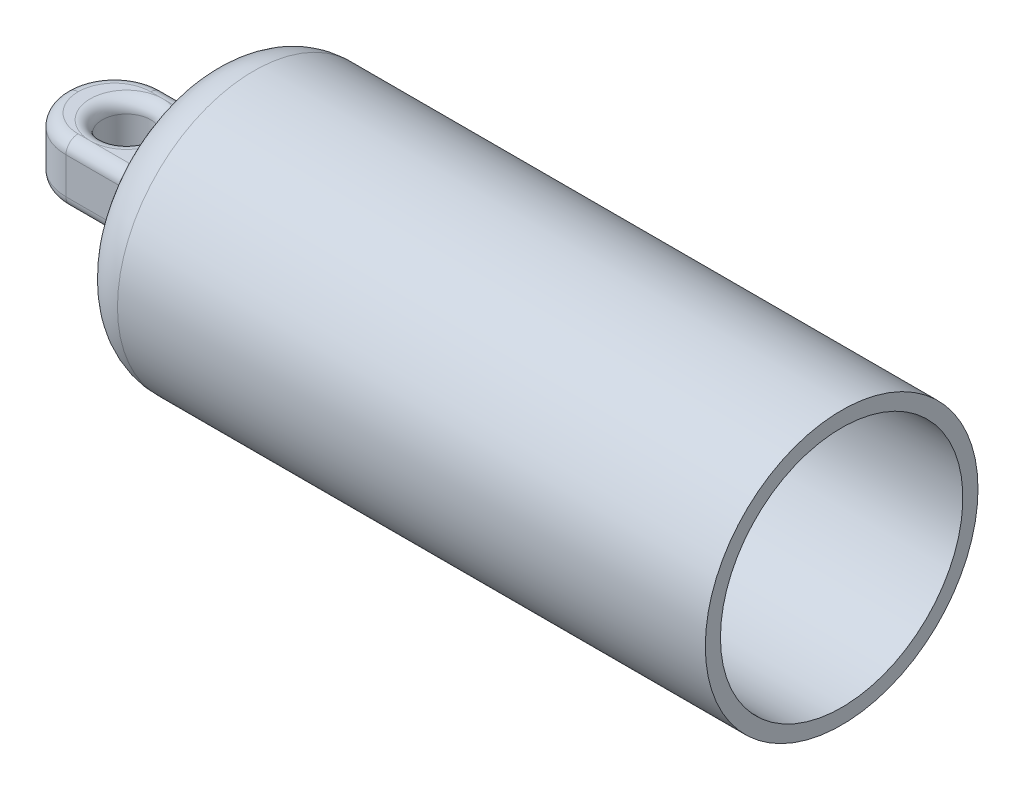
ISO-10303-21;
HEADER;
FILE_DESCRIPTION(('STEP AP214'),'2;1');
FILE_NAME('part.step','',(''),(''),'','','');
FILE_SCHEMA(('AUTOMOTIVE_DESIGN { 1 0 10303 214 1 1 1 1 }'));
ENDSEC;
DATA;
#1=APPLICATION_CONTEXT('core data for automotive mechanical design processes');
#2=APPLICATION_PROTOCOL_DEFINITION('international standard','automotive_design',2000,#1);
#3=PRODUCT_CONTEXT('',#1,'mechanical');
#4=PRODUCT('Part','Part','',(#3));
#5=PRODUCT_RELATED_PRODUCT_CATEGORY('part','',(#4));
#6=PRODUCT_DEFINITION_FORMATION('','',#4);
#7=PRODUCT_DEFINITION_CONTEXT('part definition',#1,'design');
#8=PRODUCT_DEFINITION('design','',#6,#7);
#9=PRODUCT_DEFINITION_SHAPE('','',#8);
#10=(LENGTH_UNIT() NAMED_UNIT(*) SI_UNIT(.MILLI.,.METRE.));
#11=(NAMED_UNIT(*) PLANE_ANGLE_UNIT() SI_UNIT($,.RADIAN.));
#12=(NAMED_UNIT(*) SI_UNIT($,.STERADIAN.) SOLID_ANGLE_UNIT());
#13=UNCERTAINTY_MEASURE_WITH_UNIT(LENGTH_MEASURE(1.E-05),#10,'distance_accuracy_value','');
#14=(GEOMETRIC_REPRESENTATION_CONTEXT(3) GLOBAL_UNCERTAINTY_ASSIGNED_CONTEXT((#13)) GLOBAL_UNIT_ASSIGNED_CONTEXT((#10,
#11,#12)) REPRESENTATION_CONTEXT('',''));
#15=CARTESIAN_POINT('',(0.,0.,0.));
#16=DIRECTION('',(0.,0.,1.));
#17=DIRECTION('',(1.,0.,0.));
#18=AXIS2_PLACEMENT_3D('',#15,#16,#17);
#19=CARTESIAN_POINT('',(0.,-3.,-6.));
#20=DIRECTION('',(1.,0.,0.));
#21=DIRECTION('',(0.,0.,-1.));
#22=AXIS2_PLACEMENT_3D('',#19,#20,#21);
#23=CYLINDRICAL_SURFACE('',#22,2.);
#24=CARTESIAN_POINT('',(-7.,-3.,-6.));
#25=DIRECTION('',(1.,0.,0.));
#26=DIRECTION('',(0.,0.,-1.));
#27=AXIS2_PLACEMENT_3D('',#24,#25,#26);
#28=CIRCLE('',#27,2.);
#29=CARTESIAN_POINT('',(-7.,-5.,-6.));
#30=VERTEX_POINT('',#29);
#31=CARTESIAN_POINT('',(-7.,-3.,-8.));
#32=VERTEX_POINT('',#31);
#33=EDGE_CURVE('E11',#30,#32,#28,.T.);
#34=ORIENTED_EDGE('',*,*,#33,.F.);
#35=DIRECTION('',(1.,0.,0.));
#36=VECTOR('',#35,1.);
#37=CARTESIAN_POINT('',(0.,-5.,-6.));
#38=LINE('',#37,#36);
#39=CARTESIAN_POINT('',(-20.,-5.,-6.));
#40=VERTEX_POINT('',#39);
#41=EDGE_CURVE('E140',#40,#30,#38,.T.);
#42=ORIENTED_EDGE('',*,*,#41,.F.);
#43=CARTESIAN_POINT('',(-20.,-3.,-6.));
#44=DIRECTION('',(1.,0.,0.));
#45=DIRECTION('',(0.,0.,-1.));
#46=AXIS2_PLACEMENT_3D('',#43,#44,#45);
#47=CIRCLE('',#46,2.);
#48=CARTESIAN_POINT('',(-20.,-3.,-8.));
#49=VERTEX_POINT('',#48);
#50=EDGE_CURVE('E45',#40,#49,#47,.T.);
#51=ORIENTED_EDGE('',*,*,#50,.T.);
#52=DIRECTION('',(1.,0.,0.));
#53=VECTOR('',#52,1.);
#54=CARTESIAN_POINT('',(0.,-3.,-8.));
#55=LINE('',#54,#53);
#56=EDGE_CURVE('E296',#32,#49,#55,.F.);
#57=ORIENTED_EDGE('',*,*,#56,.F.);
#58=EDGE_LOOP('',(#34,#42,#51,#57));
#59=FACE_BOUND('',#58,.T.);
#60=ADVANCED_FACE('F34',(#59),#23,.T.);
#61=CARTESIAN_POINT('',(-20.,-3.,0.));
#62=DIRECTION('',(0.,-1.,0.));
#63=DIRECTION('',(0.,0.,-1.));
#64=AXIS2_PLACEMENT_3D('',#61,#62,#63);
#65=TOROIDAL_SURFACE('',#64,6.,2.);
#66=ORIENTED_EDGE('',*,*,#50,.F.);
#67=CARTESIAN_POINT('',(-20.,-5.,0.));
#68=DIRECTION('',(0.,-1.,0.));
#69=DIRECTION('',(0.,0.,-1.));
#70=AXIS2_PLACEMENT_3D('',#67,#68,#69);
#71=CIRCLE('',#70,6.);
#72=CARTESIAN_POINT('',(-26.,-5.,0.));
#73=VERTEX_POINT('',#72);
#74=EDGE_CURVE('E313',#73,#40,#71,.T.);
#75=ORIENTED_EDGE('',*,*,#74,.F.);
#76=CARTESIAN_POINT('',(-26.,-3.,0.));
#77=DIRECTION('',(0.,0.,-1.));
#78=DIRECTION('',(-1.,0.,0.));
#79=AXIS2_PLACEMENT_3D('',#76,#77,#78);
#80=CIRCLE('',#79,2.);
#81=CARTESIAN_POINT('',(-28.,-3.,0.));
#82=VERTEX_POINT('',#81);
#83=EDGE_CURVE('E289',#73,#82,#80,.T.);
#84=ORIENTED_EDGE('',*,*,#83,.T.);
#85=CARTESIAN_POINT('',(-20.,-3.,0.));
#86=DIRECTION('',(0.,-1.,0.));
#87=DIRECTION('',(0.,0.,-1.));
#88=AXIS2_PLACEMENT_3D('',#85,#86,#87);
#89=CIRCLE('',#88,8.);
#90=EDGE_CURVE('E298',#49,#82,#89,.F.);
#91=ORIENTED_EDGE('',*,*,#90,.F.);
#92=EDGE_LOOP('',(#66,#75,#84,#91));
#93=FACE_BOUND('',#92,.T.);
#94=ADVANCED_FACE('F408',(#93),#65,.T.);
#95=CARTESIAN_POINT('',(-20.,-3.,0.));
#96=DIRECTION('',(0.,-1.,0.));
#97=DIRECTION('',(0.,0.,-1.));
#98=AXIS2_PLACEMENT_3D('',#95,#96,#97);
#99=TOROIDAL_SURFACE('',#98,6.,2.);
#100=ORIENTED_EDGE('',*,*,#83,.F.);
#101=CARTESIAN_POINT('',(-20.,-5.,0.));
#102=DIRECTION('',(0.,-1.,0.));
#103=DIRECTION('',(0.,0.,-1.));
#104=AXIS2_PLACEMENT_3D('',#101,#102,#103);
#105=CIRCLE('',#104,6.);
#106=CARTESIAN_POINT('',(-20.,-5.,6.));
#107=VERTEX_POINT('',#106);
#108=EDGE_CURVE('E310',#107,#73,#105,.T.);
#109=ORIENTED_EDGE('',*,*,#108,.F.);
#110=CARTESIAN_POINT('',(-20.,-3.,6.));
#111=DIRECTION('',(-1.,0.,0.));
#112=DIRECTION('',(0.,0.,1.));
#113=AXIS2_PLACEMENT_3D('',#110,#111,#112);
#114=CIRCLE('',#113,2.);
#115=CARTESIAN_POINT('',(-20.,-3.,8.));
#116=VERTEX_POINT('',#115);
#117=EDGE_CURVE('E291',#107,#116,#114,.T.);
#118=ORIENTED_EDGE('',*,*,#117,.T.);
#119=CARTESIAN_POINT('',(-20.,-3.,0.));
#120=DIRECTION('',(0.,-1.,0.));
#121=DIRECTION('',(0.,0.,-1.));
#122=AXIS2_PLACEMENT_3D('',#119,#120,#121);
#123=CIRCLE('',#122,8.);
#124=EDGE_CURVE('E301',#82,#116,#123,.F.);
#125=ORIENTED_EDGE('',*,*,#124,.F.);
#126=EDGE_LOOP('',(#100,#109,#118,#125));
#127=FACE_BOUND('',#126,.T.);
#128=ADVANCED_FACE('F413',(#127),#99,.T.);
#129=CARTESIAN_POINT('',(0.,-3.,6.));
#130=DIRECTION('',(-1.,0.,0.));
#131=DIRECTION('',(0.,0.,1.));
#132=AXIS2_PLACEMENT_3D('',#129,#130,#131);
#133=CYLINDRICAL_SURFACE('',#132,2.);
#134=ORIENTED_EDGE('',*,*,#117,.F.);
#135=DIRECTION('',(-1.,0.,0.));
#136=VECTOR('',#135,1.);
#137=CARTESIAN_POINT('',(0.,-5.,6.));
#138=LINE('',#137,#136);
#139=CARTESIAN_POINT('',(-7.,-5.,6.));
#140=VERTEX_POINT('',#139);
#141=EDGE_CURVE('E307',#140,#107,#138,.T.);
#142=ORIENTED_EDGE('',*,*,#141,.F.);
#143=CARTESIAN_POINT('',(-7.,-3.,6.));
#144=DIRECTION('',(-1.,0.,0.));
#145=DIRECTION('',(0.,0.,1.));
#146=AXIS2_PLACEMENT_3D('',#143,#144,#145);
#147=CIRCLE('',#146,2.);
#148=CARTESIAN_POINT('',(-7.,-3.,8.));
#149=VERTEX_POINT('',#148);
#150=EDGE_CURVE('E145',#140,#149,#147,.T.);
#151=ORIENTED_EDGE('',*,*,#150,.T.);
#152=DIRECTION('',(-1.,0.,0.));
#153=VECTOR('',#152,1.);
#154=CARTESIAN_POINT('',(0.,-3.,8.));
#155=LINE('',#154,#153);
#156=EDGE_CURVE('E304',#116,#149,#155,.F.);
#157=ORIENTED_EDGE('',*,*,#156,.F.);
#158=EDGE_LOOP('',(#134,#142,#151,#157));
#159=FACE_BOUND('',#158,.T.);
#160=ADVANCED_FACE('F277',(#159),#133,.T.);
#161=CARTESIAN_POINT('',(-5.,-7.,10.));
#162=CARTESIAN_POINT('',(-5.,-7.,10.));
#163=CARTESIAN_POINT('',(-5.,-7.,10.));
#164=CARTESIAN_POINT('',(-5.00000398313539,-6.90181951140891,9.95090975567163));
#165=CARTESIAN_POINT('',(-4.99998459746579,-6.92636476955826,9.92636476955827));
#166=CARTESIAN_POINT('',(-5.00000398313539,-6.95090975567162,9.90181951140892));
#167=CARTESIAN_POINT('',(-5.00180731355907,-6.80365615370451,9.90182807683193));
#168=CARTESIAN_POINT('',(-5.00361936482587,-6.85267601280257,9.85267601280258));
#169=CARTESIAN_POINT('',(-5.00180731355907,-6.90182807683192,9.80365615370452));
#170=CARTESIAN_POINT('',(-5.00903975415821,-6.60758622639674,9.80379311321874));
#171=CARTESIAN_POINT('',(-5.01807309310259,-6.70602285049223,9.70602285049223));
#172=CARTESIAN_POINT('',(-5.00903975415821,-6.80379311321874,9.60758622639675));
#173=CARTESIAN_POINT('',(-5.01446927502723,-6.5096796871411,9.75483984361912));
#174=CARTESIAN_POINT('',(-5.02891897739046,-6.63292707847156,9.63292707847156));
#175=CARTESIAN_POINT('',(-5.01446927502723,-6.75483984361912,9.5096796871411));
#176=CARTESIAN_POINT('',(-5.03627399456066,-6.21621671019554,9.60810835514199));
#177=CARTESIAN_POINT('',(-5.07238688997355,-6.41485564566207,9.41485564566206));
#178=CARTESIAN_POINT('',(-5.03627399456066,-6.60810835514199,9.21621671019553));
#179=CARTESIAN_POINT('',(-5.05816565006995,-6.02141786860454,9.5107089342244));
#180=CARTESIAN_POINT('',(-5.11611878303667,-6.27150495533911,9.27150495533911));
#181=CARTESIAN_POINT('',(-5.05816565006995,-6.5107089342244,9.02141786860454));
#182=CARTESIAN_POINT('',(-5.11900026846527,-5.62402709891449,9.31201354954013));
#183=CARTESIAN_POINT('',(-5.23501724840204,-5.9870622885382,8.9870622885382));
#184=CARTESIAN_POINT('',(-5.11900026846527,-6.31201354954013,8.6240270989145));
#185=CARTESIAN_POINT('',(-5.15895016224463,-5.42174073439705,9.21087036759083));
#186=CARTESIAN_POINT('',(-5.31295189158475,-5.84586328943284,8.84586328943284));
#187=CARTESIAN_POINT('',(-5.15895016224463,-6.21087036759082,8.42174073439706));
#188=CARTESIAN_POINT('',(-5.25698731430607,-5.02607918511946,9.01303959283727));
#189=CARTESIAN_POINT('',(-5.49717698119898,-5.58392565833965,8.58392565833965));
#190=CARTESIAN_POINT('',(-5.25698731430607,-6.01303959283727,8.02607918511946));
#191=CARTESIAN_POINT('',(-5.31506860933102,-4.83270109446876,8.91635054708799));
#192=CARTESIAN_POINT('',(-5.60492369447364,-5.46261640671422,8.46261640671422));
#193=CARTESIAN_POINT('',(-5.31506860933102,-5.91635054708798,7.83270109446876));
#194=CARTESIAN_POINT('',(-5.44828116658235,-4.46661266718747,8.73330633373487));
#195=CARTESIAN_POINT('',(-5.83752993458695,-5.25365927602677,8.25365927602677));
#196=CARTESIAN_POINT('',(-5.44828116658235,-5.73330633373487,7.46661266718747));
#197=CARTESIAN_POINT('',(-5.52272454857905,-4.2934092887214,8.64670464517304));
#198=CARTESIAN_POINT('',(-5.96323822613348,-5.16505097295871,8.16505097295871));
#199=CARTESIAN_POINT('',(-5.52272454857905,-5.64670464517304,7.2934092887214));
#200=CARTESIAN_POINT('',(-5.6910310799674,-3.96661081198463,8.48330540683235));
#201=CARTESIAN_POINT('',(-6.2213876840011,-5.02459296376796,8.02459296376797));
#202=CARTESIAN_POINT('',(-5.6910310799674,-5.48330540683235,6.96661081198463));
#203=CARTESIAN_POINT('',(-5.78489270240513,-3.81301417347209,8.40650708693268));
#204=CARTESIAN_POINT('',(-6.35471151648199,-4.97392287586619,7.97392287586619));
#205=CARTESIAN_POINT('',(-5.78489270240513,-5.40650708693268,6.81301417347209));
#206=CARTESIAN_POINT('',(-5.98128644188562,-3.55064548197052,8.27532274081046));
#207=CARTESIAN_POINT('',(-6.58813219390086,-4.91789051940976,7.91789051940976));
#208=CARTESIAN_POINT('',(-5.98128644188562,-5.27532274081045,6.55064548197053));
#209=CARTESIAN_POINT('',(-6.08169977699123,-3.43879040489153,8.21939520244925));
#210=CARTESIAN_POINT('',(-6.69007174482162,-4.90945241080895,7.90945241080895));
#211=CARTESIAN_POINT('',(-6.08169977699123,-5.21939520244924,6.43879040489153));
#212=CARTESIAN_POINT('',(-6.24303240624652,-3.29569542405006,8.14784771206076));
#213=CARTESIAN_POINT('',(-6.81284028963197,-4.91582329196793,7.91582329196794));
#214=CARTESIAN_POINT('',(-6.24303240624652,-5.14784771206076,6.29569542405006));
#215=CARTESIAN_POINT('',(-6.29855839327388,-3.25213069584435,8.12606534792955));
#216=CARTESIAN_POINT('',(-6.84889836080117,-4.92131905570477,7.92131905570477));
#217=CARTESIAN_POINT('',(-6.29855839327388,-5.12606534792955,6.25213069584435));
#218=CARTESIAN_POINT('',(-6.41282512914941,-3.17437141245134,8.08718570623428));
#219=CARTESIAN_POINT('',(-6.90928061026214,-4.93600518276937,7.93600518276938));
#220=CARTESIAN_POINT('',(-6.41282512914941,-5.08718570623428,6.17437141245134));
#221=CARTESIAN_POINT('',(-6.47156494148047,-3.14017414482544,8.07008707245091));
#222=CARTESIAN_POINT('',(-6.93331517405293,-4.94523410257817,7.94523410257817));
#223=CARTESIAN_POINT('',(-6.47156494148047,-5.07008707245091,6.14017414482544));
#224=CARTESIAN_POINT('',(-6.58434703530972,-3.08583007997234,8.04291503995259));
#225=CARTESIAN_POINT('',(-6.96727911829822,-4.96278176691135,7.96278176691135));
#226=CARTESIAN_POINT('',(-6.58434703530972,-5.04291503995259,6.08583007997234));
#227=CARTESIAN_POINT('',(-6.63810127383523,-3.06448603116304,8.03224301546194));
#228=CARTESIAN_POINT('',(-6.97840944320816,-4.97106115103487,7.97106115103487));
#229=CARTESIAN_POINT('',(-6.63810127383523,-5.03224301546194,6.06448603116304));
#230=CARTESIAN_POINT('',(-6.74697780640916,-3.03061111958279,8.01530555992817));
#231=CARTESIAN_POINT('',(-6.99325744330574,-4.98529392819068,7.98529392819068));
#232=CARTESIAN_POINT('',(-6.74697780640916,-5.01530555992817,6.03061111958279));
#233=CARTESIAN_POINT('',(-6.80209970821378,-3.01807775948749,8.00903888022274));
#234=CARTESIAN_POINT('',(-6.99688594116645,-4.99119981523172,7.99119981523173));
#235=CARTESIAN_POINT('',(-6.80209970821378,-5.00903888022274,6.01807775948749));
#236=CARTESIAN_POINT('',(-6.91296053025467,-3.00224572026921,8.00112286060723));
#237=CARTESIAN_POINT('',(-7.00024344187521,-4.9988330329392,7.9988330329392));
#238=CARTESIAN_POINT('',(-6.91296053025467,-5.00112286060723,6.00224572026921));
#239=CARTESIAN_POINT('',(-6.96869891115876,-2.99893952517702,7.99946976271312));
#240=CARTESIAN_POINT('',(-6.99995265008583,-5.00052997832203,8.00052997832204));
#241=CARTESIAN_POINT('',(-6.96869891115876,-4.99946976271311,5.99893952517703));
#242=CARTESIAN_POINT('',(-7.08005949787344,-3.00165484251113,8.00082742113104));
#243=CARTESIAN_POINT('',(-7.00006180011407,-4.99917345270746,7.99917345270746));
#244=CARTESIAN_POINT('',(-7.08005949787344,-5.00082742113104,6.00165484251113));
#245=CARTESIAN_POINT('',(-7.13568171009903,-3.00767582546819,8.00383791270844));
#246=CARTESIAN_POINT('',(-7.00046098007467,-4.99612663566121,7.99612663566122));
#247=CARTESIAN_POINT('',(-7.13568171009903,-5.00383791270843,6.00767582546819));
#248=CARTESIAN_POINT('',(-7.24145834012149,-3.02795689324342,8.01397844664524));
#249=CARTESIAN_POINT('',(-7.00616750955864,-4.98662965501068,7.98662965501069));
#250=CARTESIAN_POINT('',(-7.24145834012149,-5.01397844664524,6.02795689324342));
#251=CARTESIAN_POINT('',(-7.29168320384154,-3.04149116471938,8.02074558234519));
#252=CARTESIAN_POINT('',(-7.01103160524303,-4.98051828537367,7.98051828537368));
#253=CARTESIAN_POINT('',(-7.29168320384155,-5.02074558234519,6.04149116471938));
#254=CARTESIAN_POINT('',(-7.39088096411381,-3.07584274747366,8.03792137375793));
#255=CARTESIAN_POINT('',(-7.02752616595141,-4.96668757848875,7.96668757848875));
#256=CARTESIAN_POINT('',(-7.39088096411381,-5.03792137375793,6.07584274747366));
#257=CARTESIAN_POINT('',(-7.43985319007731,-3.09666387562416,8.04833193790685));
#258=CARTESIAN_POINT('',(-7.03907821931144,-4.95900295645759,7.95900295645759));
#259=CARTESIAN_POINT('',(-7.43985319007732,-5.04833193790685,6.09666387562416));
#260=CARTESIAN_POINT('',(-7.58423100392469,-3.16933795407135,8.08466897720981));
#261=CARTESIAN_POINT('',(-7.08583109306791,-4.93664657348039,7.93664657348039));
#262=CARTESIAN_POINT('',(-7.58423100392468,-5.0846689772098,6.16933795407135));
#263=CARTESIAN_POINT('',(-7.67713252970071,-3.23140876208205,8.11570438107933));
#264=CARTESIAN_POINT('',(-7.13282901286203,-4.92251223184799,7.92251223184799));
#265=CARTESIAN_POINT('',(-7.67713252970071,-5.11570438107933,6.23140876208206));
#266=CARTESIAN_POINT('',(-7.86160274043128,-3.38418162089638,8.19209081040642));
#267=CARTESIAN_POINT('',(-7.26185684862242,-4.90954229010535,7.90954229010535));
#268=CARTESIAN_POINT('',(-7.86160274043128,-5.19209081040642,6.38418162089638));
#269=CARTESIAN_POINT('',(-7.95228655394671,-3.47696964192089,8.23848482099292));
#270=CARTESIAN_POINT('',(-7.34538455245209,-4.91167090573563,7.91167090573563));
#271=CARTESIAN_POINT('',(-7.95228655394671,-5.23848482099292,6.4769696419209));
#272=CARTESIAN_POINT('',(-8.12159531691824,-3.68226607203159,8.34113303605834));
#273=CARTESIAN_POINT('',(-7.53016833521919,-4.94276373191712,7.94276373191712));
#274=CARTESIAN_POINT('',(-8.12159531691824,-5.34113303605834,6.68226607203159));
#275=CARTESIAN_POINT('',(-8.2002104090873,-3.79479044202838,8.39739522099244));
#276=CARTESIAN_POINT('',(-7.63070600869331,-4.97082789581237,7.97082789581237));
#277=CARTESIAN_POINT('',(-8.2002104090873,-5.39739522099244,6.79479044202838));
#278=CARTESIAN_POINT('',(-8.36292386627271,-4.06326735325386,8.53163367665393));
#279=CARTESIAN_POINT('',(-7.85715624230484,-5.0625446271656,8.06254462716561));
#280=CARTESIAN_POINT('',(-8.36292386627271,-5.53163367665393,7.06326735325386));
#281=CARTESIAN_POINT('',(-8.44375946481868,-4.22314446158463,8.61157223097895));
#282=CARTESIAN_POINT('',(-7.98461441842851,-5.13229782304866,8.13229782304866));
#283=CARTESIAN_POINT('',(-8.44375946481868,-5.61157223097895,7.22314446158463));
#284=CARTESIAN_POINT('',(-8.58784778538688,-4.55790640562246,8.7789532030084));
#285=CARTESIAN_POINT('',(-8.22336908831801,-5.30321332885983,8.30321332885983));
#286=CARTESIAN_POINT('',(-8.58784778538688,-5.77895320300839,7.55790640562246));
#287=CARTESIAN_POINT('',(-8.65108325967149,-4.73280574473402,8.86640287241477));
#288=CARTESIAN_POINT('',(-8.33583717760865,-5.40381079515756,8.40381079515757));
#289=CARTESIAN_POINT('',(-8.65108325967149,-5.86640287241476,7.73280574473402));
#290=CARTESIAN_POINT('',(-8.7697340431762,-5.12073509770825,9.0603675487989));
#291=CARTESIAN_POINT('',(-8.55105376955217,-5.64363115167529,8.6436311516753));
#292=CARTESIAN_POINT('',(-8.7697340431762,-6.0603675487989,8.12073509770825));
#293=CARTESIAN_POINT('',(-8.82237757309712,-5.33544939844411,9.16772469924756));
#294=CARTESIAN_POINT('',(-8.65192997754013,-5.78724707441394,8.78724707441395));
#295=CARTESIAN_POINT('',(-8.82237757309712,-6.16772469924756,8.33544939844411));
#296=CARTESIAN_POINT('',(-8.90713561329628,-5.77267827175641,9.38633913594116));
#297=CARTESIAN_POINT('',(-8.81515563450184,-6.09117316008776,9.09117316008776));
#298=CARTESIAN_POINT('',(-8.90713561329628,-6.38633913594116,8.77267827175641));
#299=CARTESIAN_POINT('',(-8.93924869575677,-5.99519338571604,9.49759669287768));
#300=CARTESIAN_POINT('',(-8.87906704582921,-6.25256243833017,9.25256243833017));
#301=CARTESIAN_POINT('',(-8.93924869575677,-6.49759669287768,8.99519338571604));
#302=CARTESIAN_POINT('',(-8.98465774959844,-6.45177933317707,9.7258896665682));
#303=CARTESIAN_POINT('',(-8.96897311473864,-6.58821760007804,9.58821760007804));
#304=CARTESIAN_POINT('',(-8.98465774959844,-6.7258896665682,9.45177933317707));
#305=CARTESIAN_POINT('',(-8.99727081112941,-6.68598479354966,9.84299239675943));
#306=CARTESIAN_POINT('',(-8.99454064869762,-6.76442980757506,9.76442980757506));
#307=CARTESIAN_POINT('',(-8.99727081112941,-6.84299239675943,9.68598479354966));
#308=CARTESIAN_POINT('',(-9.00193774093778,-7.15488056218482,10.0774402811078));
#309=CARTESIAN_POINT('',(-9.00387109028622,-7.11602197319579,10.1160219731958));
#310=CARTESIAN_POINT('',(-9.00193774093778,-7.07744028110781,10.1548805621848));
#311=CARTESIAN_POINT('',(-8.99398494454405,-7.38957100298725,10.1947855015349));
#312=CARTESIAN_POINT('',(-8.98771753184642,-7.29322060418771,10.2932206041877));
#313=CARTESIAN_POINT('',(-8.99398494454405,-7.1947855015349,10.3895710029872));
#314=CARTESIAN_POINT('',(-8.95875267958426,-7.83673641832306,10.4183682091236));
#315=CARTESIAN_POINT('',(-8.91773062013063,-7.62432849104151,10.6243284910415));
#316=CARTESIAN_POINT('',(-8.95875267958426,-7.41836820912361,10.8367364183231));
#317=CARTESIAN_POINT('',(-8.93309597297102,-8.04946709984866,10.5247335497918));
#318=CARTESIAN_POINT('',(-8.8664345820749,-7.78046443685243,10.7804644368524));
#319=CARTESIAN_POINT('',(-8.93309597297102,-7.5247335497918,11.0494670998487));
#320=CARTESIAN_POINT('',(-8.86358789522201,-8.46862076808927,10.7343103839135));
#321=CARTESIAN_POINT('',(-8.7311960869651,-8.07787224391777,11.0778722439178));
#322=CARTESIAN_POINT('',(-8.86358789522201,-7.73431038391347,11.4686207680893));
#323=CARTESIAN_POINT('',(-8.81976787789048,-8.67505396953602,10.8375269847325));
#324=CARTESIAN_POINT('',(-8.64613461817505,-8.22022547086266,11.2202254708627));
#325=CARTESIAN_POINT('',(-8.81976787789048,-7.83752698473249,11.675053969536));
#326=CARTESIAN_POINT('',(-8.7217138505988,-9.04423149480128,11.0221157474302));
#327=CARTESIAN_POINT('',(-8.46404617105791,-8.45954570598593,11.4595457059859));
#328=CARTESIAN_POINT('',(-8.7217138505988,-8.02211574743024,12.0442314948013));
#329=CARTESIAN_POINT('',(-8.67043045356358,-9.20852532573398,11.1042626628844));
#330=CARTESIAN_POINT('',(-8.37000411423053,-8.56087790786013,11.5608779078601));
#331=CARTESIAN_POINT('',(-8.67043045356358,-8.10426266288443,12.208525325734));
#332=CARTESIAN_POINT('',(-8.58274442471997,-9.4473404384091,11.2236702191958));
#333=CARTESIAN_POINT('',(-8.21828856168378,-8.69563133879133,11.6956313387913));
#334=CARTESIAN_POINT('',(-8.58274442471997,-8.2236702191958,12.4473404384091));
#335=CARTESIAN_POINT('',(-8.55165981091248,-9.52580220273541,11.2629011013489));
#336=CARTESIAN_POINT('',(-8.16511946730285,-8.73818378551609,11.7381837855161));
#337=CARTESIAN_POINT('',(-8.55165981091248,-8.26290110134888,12.5258022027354));
#338=CARTESIAN_POINT('',(-8.48576226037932,-9.67960542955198,11.3398027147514));
#339=CARTESIAN_POINT('',(-8.05577845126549,-8.81703790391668,11.8170379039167));
#340=CARTESIAN_POINT('',(-8.48576226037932,-8.33980271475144,12.679605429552));
#341=CARTESIAN_POINT('',(-8.45094649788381,-9.75494446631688,11.3774722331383));
#342=CARTESIAN_POINT('',(-7.99949460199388,-8.85327792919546,11.8532779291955));
#343=CARTESIAN_POINT('',(-8.45094649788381,-8.37747223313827,12.7549444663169));
#344=CARTESIAN_POINT('',(-8.4142135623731,-9.82842712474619,11.4142135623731));
#345=CARTESIAN_POINT('',(-7.94280904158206,-8.88561808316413,11.8856180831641));
#346=CARTESIAN_POINT('',(-8.41421356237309,-8.41421356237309,12.8284271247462));
#347=(BOUNDED_SURFACE() B_SPLINE_SURFACE(3,2,((#161,#162,#163),(#164,#165,#166),(#167,#168,
#169),(#170,#171,#172),(#173,#174,#175),(#176,#177,#178),(#179,#180,#181),(#182,#183,#184),
(#185,#186,#187),(#188,#189,#190),(#191,#192,#193),(#194,#195,#196),(#197,#198,#199),(#200,#201,
#202),(#203,#204,#205),(#206,#207,#208),(#209,#210,#211),(#212,#213,#214),(#215,#216,#217),
(#218,#219,#220),(#221,#222,#223),(#224,#225,#226),(#227,#228,#229),(#230,#231,#232),(#233,#234,
#235),(#236,#237,#238),(#239,#240,#241),(#242,#243,#244),(#245,#246,#247),(#248,#249,#250),
(#251,#252,#253),(#254,#255,#256),(#257,#258,#259),(#260,#261,#262),(#263,#264,#265),(#266,#267,
#268),(#269,#270,#271),(#272,#273,#274),(#275,#276,#277),(#278,#279,#280),(#281,#282,#283),
(#284,#285,#286),(#287,#288,#289),(#290,#291,#292),(#293,#294,#295),(#296,#297,#298),(#299,#300,
#301),(#302,#303,#304),(#305,#306,#307),(#308,#309,#310),(#311,#312,#313),(#314,#315,#316),
(#317,#318,#319),(#320,#321,#322),(#323,#324,#325),(#326,#327,#328),(#329,#330,#331),(#332,#333,
#334),(#335,#336,#337),(#338,#339,#340),(#341,#342,#343),(#344,#345,#346)),.UNSPECIFIED.,.F.,
.F.,.F.) B_SPLINE_SURFACE_WITH_KNOTS((4,2,2,2,2,2,2,2,2,2,2,2,2,2,2,2,2,2,2,2,2,2,2,2,2,2,2,2,2,
2,4),(3,3),(0.,0.416447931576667,0.832943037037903,1.66804803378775,2.55691145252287,
3.44548283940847,4.30211554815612,5.15868092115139,5.92017078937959,6.30045376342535,
6.68062650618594,7.0149410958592,7.34916088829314,7.68310836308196,8.01703688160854,
8.3232316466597,8.62958703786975,9.24209070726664,9.91013934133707,10.57873074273,
11.40882745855,12.2397348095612,13.200653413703,14.1616388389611,15.155572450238,
16.1498282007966,17.0633021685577,17.9752058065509,18.7352084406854,19.1165167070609,
19.4981158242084),(0.,1.),
.UNSPECIFIED.) GEOMETRIC_REPRESENTATION_ITEM() RATIONAL_B_SPLINE_SURFACE(((1.,1.,1.),(1.,
0.999999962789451,1.),(1.,0.999548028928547,1.),(1.,0.997742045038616,1.),(1.,0.996387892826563,
1.),(1.,0.990965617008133,1.),(1.,0.985537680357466,1.),(1.,0.970672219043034,1.),(1.,
0.960999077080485,1.),(1.,0.937865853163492,1.),(1.,0.924407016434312,1.),(1.,0.894792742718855,
1.),(1.,0.878751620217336,1.),(1.,0.844731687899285,1.),(1.,0.82675303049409,1.),(1.,
0.793040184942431,1.),(1.,0.77727836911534,1.),(1.,0.755855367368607,1.),(1.,0.749087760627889,
1.),(1.,0.7367004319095,1.),(1.,0.731080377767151,1.),(1.,0.721987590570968,1.),(1.,
0.718337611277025,1.),(1.,0.712489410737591,1.),(1.,0.71029077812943,1.),(1.,0.707506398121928,
1.),(1.,0.706919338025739,1.),(1.,0.707399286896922,1.),(1.,0.708466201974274,1.),(1.,
0.712018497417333,1.),(1.,0.714378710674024,1.),(1.,0.720276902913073,1.),(1.,0.723815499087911,
1.),(1.,0.735918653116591,1.),(1.,0.745971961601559,1.),(1.,0.769268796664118,1.),(1.,
0.782718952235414,1.),(1.,0.810272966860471,1.),(1.,0.824377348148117,1.),(1.,0.855258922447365,
1.),(1.,0.871858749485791,1.),(1.,0.902635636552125,1.),(1.,0.916810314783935,1.),(1.,
0.944034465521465,1.),(1.,0.956560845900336,1.),(1.,0.977000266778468,1.),(1.,0.984912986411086,
1.),(1.,0.996154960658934,1.),(1.,0.999317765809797,1.),(1.,1.00048438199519,1.),(1.,
0.998486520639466,1.),(1.,0.989732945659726,1.),(1.,0.983376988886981,1.),(1.,0.96645660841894,
1.),(1.,0.955899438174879,1.),(1.,0.932951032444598,1.),(1.,0.921158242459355,1.),(1.,
0.901704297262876,1.),(1.,0.894912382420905,1.),(1.,0.880824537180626,1.),(1.,0.873528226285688,
1.),(1.,0.866025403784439,1.))) REPRESENTATION_ITEM('') SURFACE());
#348=ORIENTED_EDGE('',*,*,#150,.F.);
#349=CARTESIAN_POINT('',(-7.,-7.,10.));
#350=DIRECTION('',(0.,-0.894427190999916,-0.447213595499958));
#351=DIRECTION('',(0.,-0.447213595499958,0.894427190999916));
#352=AXIS2_PLACEMENT_3D('',#349,#350,#351);
#353=ELLIPSE('',#352,4.47213595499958,2.);
#354=CARTESIAN_POINT('',(-5.,-7.,10.));
#355=VERTEX_POINT('',#354);
#356=EDGE_CURVE('E141',#355,#140,#353,.F.);
#357=ORIENTED_EDGE('',*,*,#356,.F.);
#358=CARTESIAN_POINT('',(-7.,-7.,10.));
#359=DIRECTION('',(0.,-0.447213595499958,-0.894427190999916));
#360=DIRECTION('',(0.,-0.894427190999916,0.447213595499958));
#361=AXIS2_PLACEMENT_3D('',#358,#359,#360);
#362=ELLIPSE('',#361,4.47213595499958,2.);
#363=EDGE_CURVE('E132',#149,#355,#362,.T.);
#364=ORIENTED_EDGE('',*,*,#363,.F.);
#365=EDGE_LOOP('',(#348,#357,#364));
#366=FACE_BOUND('',#365,.T.);
#367=ADVANCED_FACE('F144',(#366),#347,.T.);
#368=CARTESIAN_POINT('',(-8.4142135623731,-9.82842712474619,-11.4142135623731));
#369=CARTESIAN_POINT('',(-7.94280904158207,-8.88561808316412,-11.8856180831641));
#370=CARTESIAN_POINT('',(-8.4142135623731,-8.41421356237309,-12.8284271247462));
#371=CARTESIAN_POINT('',(-8.45094649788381,-9.75494446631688,-11.3774722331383));
#372=CARTESIAN_POINT('',(-7.99949460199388,-8.85327792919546,-11.8532779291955));
#373=CARTESIAN_POINT('',(-8.45094649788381,-8.37747223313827,-12.7549444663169));
#374=CARTESIAN_POINT('',(-8.48576226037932,-9.67960542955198,-11.3398027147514));
#375=CARTESIAN_POINT('',(-8.05577845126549,-8.81703790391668,-11.8170379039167));
#376=CARTESIAN_POINT('',(-8.48576226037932,-8.33980271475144,-12.679605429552));
#377=CARTESIAN_POINT('',(-8.55165981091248,-9.52580220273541,-11.2629011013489));
#378=CARTESIAN_POINT('',(-8.16511946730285,-8.73818378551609,-11.7381837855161));
#379=CARTESIAN_POINT('',(-8.55165981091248,-8.26290110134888,-12.5258022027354));
#380=CARTESIAN_POINT('',(-8.58274442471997,-9.4473404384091,-11.2236702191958));
#381=CARTESIAN_POINT('',(-8.21828856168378,-8.69563133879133,-11.6956313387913));
#382=CARTESIAN_POINT('',(-8.58274442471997,-8.2236702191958,-12.4473404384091));
#383=CARTESIAN_POINT('',(-8.67043045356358,-9.20852532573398,-11.1042626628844));
#384=CARTESIAN_POINT('',(-8.37000411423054,-8.56087790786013,-11.5608779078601));
#385=CARTESIAN_POINT('',(-8.67043045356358,-8.10426266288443,-12.208525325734));
#386=CARTESIAN_POINT('',(-8.7217138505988,-9.04423149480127,-11.0221157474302));
#387=CARTESIAN_POINT('',(-8.46404617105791,-8.45954570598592,-11.4595457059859));
#388=CARTESIAN_POINT('',(-8.72171385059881,-8.02211574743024,-12.0442314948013));
#389=CARTESIAN_POINT('',(-8.81976787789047,-8.67505396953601,-10.8375269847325));
#390=CARTESIAN_POINT('',(-8.64613461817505,-8.22022547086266,-11.2202254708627));
#391=CARTESIAN_POINT('',(-8.81976787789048,-7.83752698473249,-11.675053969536));
#392=CARTESIAN_POINT('',(-8.86358789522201,-8.46862076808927,-10.7343103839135));
#393=CARTESIAN_POINT('',(-8.7311960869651,-8.07787224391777,-11.0778722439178));
#394=CARTESIAN_POINT('',(-8.86358789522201,-7.73431038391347,-11.4686207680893));
#395=CARTESIAN_POINT('',(-8.93309597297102,-8.04946709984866,-10.5247335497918));
#396=CARTESIAN_POINT('',(-8.8664345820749,-7.78046443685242,-10.7804644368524));
#397=CARTESIAN_POINT('',(-8.93309597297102,-7.5247335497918,-11.0494670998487));
#398=CARTESIAN_POINT('',(-8.95875267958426,-7.83673641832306,-10.4183682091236));
#399=CARTESIAN_POINT('',(-8.91773062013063,-7.6243284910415,-10.6243284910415));
#400=CARTESIAN_POINT('',(-8.95875267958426,-7.4183682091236,-10.8367364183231));
#401=CARTESIAN_POINT('',(-8.99398494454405,-7.38957100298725,-10.1947855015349));
#402=CARTESIAN_POINT('',(-8.98771753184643,-7.29322060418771,-10.2932206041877));
#403=CARTESIAN_POINT('',(-8.99398494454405,-7.1947855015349,-10.3895710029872));
#404=CARTESIAN_POINT('',(-9.00193774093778,-7.15488056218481,-10.0774402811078));
#405=CARTESIAN_POINT('',(-9.00387109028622,-7.11602197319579,-10.1160219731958));
#406=CARTESIAN_POINT('',(-9.00193774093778,-7.07744028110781,-10.1548805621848));
#407=CARTESIAN_POINT('',(-8.99727081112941,-6.68598479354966,-9.84299239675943));
#408=CARTESIAN_POINT('',(-8.99454064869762,-6.76442980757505,-9.76442980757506));
#409=CARTESIAN_POINT('',(-8.99727081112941,-6.84299239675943,-9.68598479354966));
#410=CARTESIAN_POINT('',(-8.98465774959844,-6.45177933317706,-9.72588966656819));
#411=CARTESIAN_POINT('',(-8.96897311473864,-6.58821760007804,-9.58821760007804));
#412=CARTESIAN_POINT('',(-8.98465774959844,-6.72588966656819,-9.45177933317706));
#413=CARTESIAN_POINT('',(-8.93924869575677,-5.99519338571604,-9.49759669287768));
#414=CARTESIAN_POINT('',(-8.87906704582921,-6.25256243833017,-9.25256243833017));
#415=CARTESIAN_POINT('',(-8.93924869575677,-6.49759669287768,-8.99519338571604));
#416=CARTESIAN_POINT('',(-8.90713561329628,-5.77267827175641,-9.38633913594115));
#417=CARTESIAN_POINT('',(-8.81515563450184,-6.09117316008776,-9.09117316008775));
#418=CARTESIAN_POINT('',(-8.90713561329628,-6.38633913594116,-8.77267827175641));
#419=CARTESIAN_POINT('',(-8.82237757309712,-5.33544939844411,-9.16772469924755));
#420=CARTESIAN_POINT('',(-8.65192997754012,-5.78724707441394,-8.78724707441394));
#421=CARTESIAN_POINT('',(-8.82237757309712,-6.16772469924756,-8.3354493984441));
#422=CARTESIAN_POINT('',(-8.7697340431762,-5.12073509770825,-9.0603675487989));
#423=CARTESIAN_POINT('',(-8.55105376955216,-5.64363115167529,-8.64363115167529));
#424=CARTESIAN_POINT('',(-8.7697340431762,-6.0603675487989,-8.12073509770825));
#425=CARTESIAN_POINT('',(-8.65108325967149,-4.73280574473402,-8.86640287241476));
#426=CARTESIAN_POINT('',(-8.33583717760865,-5.40381079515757,-8.40381079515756));
#427=CARTESIAN_POINT('',(-8.65108325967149,-5.86640287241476,-7.73280574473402));
#428=CARTESIAN_POINT('',(-8.58784778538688,-4.55790640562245,-8.77895320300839));
#429=CARTESIAN_POINT('',(-8.22336908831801,-5.30321332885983,-8.30321332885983));
#430=CARTESIAN_POINT('',(-8.58784778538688,-5.77895320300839,-7.55790640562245));
#431=CARTESIAN_POINT('',(-8.44375946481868,-4.22314446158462,-8.61157223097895));
#432=CARTESIAN_POINT('',(-7.98461441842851,-5.13229782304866,-8.13229782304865));
#433=CARTESIAN_POINT('',(-8.44375946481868,-5.61157223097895,-7.22314446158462));
#434=CARTESIAN_POINT('',(-8.36292386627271,-4.06326735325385,-8.53163367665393));
#435=CARTESIAN_POINT('',(-7.85715624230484,-5.0625446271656,-8.0625446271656));
#436=CARTESIAN_POINT('',(-8.36292386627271,-5.53163367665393,-7.06326735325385));
#437=CARTESIAN_POINT('',(-8.2002104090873,-3.79479044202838,-8.39739522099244));
#438=CARTESIAN_POINT('',(-7.63070600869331,-4.97082789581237,-7.97082789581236));
#439=CARTESIAN_POINT('',(-8.2002104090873,-5.39739522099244,-6.79479044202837));
#440=CARTESIAN_POINT('',(-8.12159531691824,-3.68226607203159,-8.34113303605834));
#441=CARTESIAN_POINT('',(-7.53016833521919,-4.94276373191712,-7.94276373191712));
#442=CARTESIAN_POINT('',(-8.12159531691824,-5.34113303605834,-6.68226607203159));
#443=CARTESIAN_POINT('',(-7.95228655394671,-3.47696964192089,-8.23848482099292));
#444=CARTESIAN_POINT('',(-7.34538455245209,-4.91167090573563,-7.91167090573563));
#445=CARTESIAN_POINT('',(-7.95228655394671,-5.23848482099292,-6.47696964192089));
#446=CARTESIAN_POINT('',(-7.86160274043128,-3.38418162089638,-8.19209081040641));
#447=CARTESIAN_POINT('',(-7.26185684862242,-4.90954229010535,-7.90954229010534));
#448=CARTESIAN_POINT('',(-7.86160274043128,-5.19209081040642,-6.38418162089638));
#449=CARTESIAN_POINT('',(-7.67713252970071,-3.23140876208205,-8.11570438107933));
#450=CARTESIAN_POINT('',(-7.13282901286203,-4.92251223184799,-7.92251223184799));
#451=CARTESIAN_POINT('',(-7.67713252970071,-5.11570438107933,-6.23140876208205));
#452=CARTESIAN_POINT('',(-7.58423100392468,-3.16933795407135,-8.0846689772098));
#453=CARTESIAN_POINT('',(-7.08583109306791,-4.93664657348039,-7.93664657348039));
#454=CARTESIAN_POINT('',(-7.58423100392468,-5.0846689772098,-6.16933795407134));
#455=CARTESIAN_POINT('',(-7.43985319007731,-3.09666387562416,-8.04833193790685));
#456=CARTESIAN_POINT('',(-7.03907821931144,-4.95900295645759,-7.95900295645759));
#457=CARTESIAN_POINT('',(-7.43985319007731,-5.04833193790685,-6.09666387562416));
#458=CARTESIAN_POINT('',(-7.39088096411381,-3.07584274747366,-8.03792137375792));
#459=CARTESIAN_POINT('',(-7.02752616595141,-4.96668757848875,-7.96668757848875));
#460=CARTESIAN_POINT('',(-7.39088096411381,-5.03792137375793,-6.07584274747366));
#461=CARTESIAN_POINT('',(-7.29168320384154,-3.04149116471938,-8.02074558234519));
#462=CARTESIAN_POINT('',(-7.01103160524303,-4.98051828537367,-7.98051828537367));
#463=CARTESIAN_POINT('',(-7.29168320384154,-5.02074558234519,-6.04149116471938));
#464=CARTESIAN_POINT('',(-7.24145834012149,-3.02795689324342,-8.01397844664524));
#465=CARTESIAN_POINT('',(-7.00616750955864,-4.98662965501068,-7.98662965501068));
#466=CARTESIAN_POINT('',(-7.24145834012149,-5.01397844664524,-6.02795689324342));
#467=CARTESIAN_POINT('',(-7.13568171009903,-3.00767582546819,-8.00383791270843));
#468=CARTESIAN_POINT('',(-7.00046098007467,-4.99612663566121,-7.99612663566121));
#469=CARTESIAN_POINT('',(-7.13568171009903,-5.00383791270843,-6.00767582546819));
#470=CARTESIAN_POINT('',(-7.08005949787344,-3.00165484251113,-8.00082742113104));
#471=CARTESIAN_POINT('',(-7.00006180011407,-4.99917345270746,-7.99917345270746));
#472=CARTESIAN_POINT('',(-7.08005949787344,-5.00082742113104,-6.00165484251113));
#473=CARTESIAN_POINT('',(-6.96869891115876,-2.99893952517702,-7.99946976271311));
#474=CARTESIAN_POINT('',(-6.99995265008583,-5.00052997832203,-8.00052997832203));
#475=CARTESIAN_POINT('',(-6.96869891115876,-4.99946976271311,-5.99893952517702));
#476=CARTESIAN_POINT('',(-6.91296053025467,-3.00224572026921,-8.00112286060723));
#477=CARTESIAN_POINT('',(-7.00024344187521,-4.9988330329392,-7.9988330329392));
#478=CARTESIAN_POINT('',(-6.91296053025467,-5.00112286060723,-6.00224572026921));
#479=CARTESIAN_POINT('',(-6.80209970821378,-3.01807775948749,-8.00903888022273));
#480=CARTESIAN_POINT('',(-6.99688594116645,-4.99119981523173,-7.99119981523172));
#481=CARTESIAN_POINT('',(-6.80209970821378,-5.00903888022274,-6.01807775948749));
#482=CARTESIAN_POINT('',(-6.74697780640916,-3.03061111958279,-8.01530555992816));
#483=CARTESIAN_POINT('',(-6.99325744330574,-4.98529392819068,-7.98529392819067));
#484=CARTESIAN_POINT('',(-6.74697780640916,-5.01530555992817,-6.03061111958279));
#485=CARTESIAN_POINT('',(-6.63810127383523,-3.06448603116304,-8.03224301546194));
#486=CARTESIAN_POINT('',(-6.97840944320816,-4.97106115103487,-7.97106115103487));
#487=CARTESIAN_POINT('',(-6.63810127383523,-5.03224301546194,-6.06448603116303));
#488=CARTESIAN_POINT('',(-6.58434703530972,-3.08583007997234,-8.04291503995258));
#489=CARTESIAN_POINT('',(-6.96727911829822,-4.96278176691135,-7.96278176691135));
#490=CARTESIAN_POINT('',(-6.58434703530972,-5.04291503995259,-6.08583007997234));
#491=CARTESIAN_POINT('',(-6.47156494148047,-3.14017414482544,-8.07008707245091));
#492=CARTESIAN_POINT('',(-6.93331517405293,-4.94523410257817,-7.94523410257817));
#493=CARTESIAN_POINT('',(-6.47156494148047,-5.07008707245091,-6.14017414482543));
#494=CARTESIAN_POINT('',(-6.41282512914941,-3.17437141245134,-8.08718570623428));
#495=CARTESIAN_POINT('',(-6.90928061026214,-4.93600518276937,-7.93600518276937));
#496=CARTESIAN_POINT('',(-6.41282512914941,-5.08718570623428,-6.17437141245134));
#497=CARTESIAN_POINT('',(-6.29855839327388,-3.25213069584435,-8.12606534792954));
#498=CARTESIAN_POINT('',(-6.84889836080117,-4.92131905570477,-7.92131905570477));
#499=CARTESIAN_POINT('',(-6.29855839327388,-5.12606534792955,-6.25213069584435));
#500=CARTESIAN_POINT('',(-6.24303240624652,-3.29569542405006,-8.14784771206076));
#501=CARTESIAN_POINT('',(-6.81284028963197,-4.91582329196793,-7.91582329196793));
#502=CARTESIAN_POINT('',(-6.24303240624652,-5.14784771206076,-6.29569542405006));
#503=CARTESIAN_POINT('',(-6.08169977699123,-3.43879040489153,-8.21939520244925));
#504=CARTESIAN_POINT('',(-6.69007174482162,-4.90945241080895,-7.90945241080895));
#505=CARTESIAN_POINT('',(-6.08169977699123,-5.21939520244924,-6.43879040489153));
#506=CARTESIAN_POINT('',(-5.98128644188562,-3.55064548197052,-8.27532274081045));
#507=CARTESIAN_POINT('',(-6.58813219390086,-4.91789051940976,-7.91789051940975));
#508=CARTESIAN_POINT('',(-5.98128644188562,-5.27532274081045,-6.55064548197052));
#509=CARTESIAN_POINT('',(-5.78489270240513,-3.81301417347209,-8.40650708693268));
#510=CARTESIAN_POINT('',(-6.35471151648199,-4.97392287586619,-7.97392287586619));
#511=CARTESIAN_POINT('',(-5.78489270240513,-5.40650708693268,-6.81301417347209));
#512=CARTESIAN_POINT('',(-5.6910310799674,-3.96661081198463,-8.48330540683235));
#513=CARTESIAN_POINT('',(-6.2213876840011,-5.02459296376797,-8.02459296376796));
#514=CARTESIAN_POINT('',(-5.6910310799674,-5.48330540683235,-6.96661081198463));
#515=CARTESIAN_POINT('',(-5.52272454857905,-4.2934092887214,-8.64670464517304));
#516=CARTESIAN_POINT('',(-5.96323822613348,-5.16505097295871,-8.16505097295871));
#517=CARTESIAN_POINT('',(-5.52272454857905,-5.64670464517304,-7.2934092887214));
#518=CARTESIAN_POINT('',(-5.44828116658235,-4.46661266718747,-8.73330633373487));
#519=CARTESIAN_POINT('',(-5.83752993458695,-5.25365927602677,-8.25365927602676));
#520=CARTESIAN_POINT('',(-5.44828116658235,-5.73330633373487,-7.46661266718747));
#521=CARTESIAN_POINT('',(-5.31506860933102,-4.83270109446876,-8.91635054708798));
#522=CARTESIAN_POINT('',(-5.60492369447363,-5.46261640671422,-8.46261640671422));
#523=CARTESIAN_POINT('',(-5.31506860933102,-5.91635054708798,-7.83270109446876));
#524=CARTESIAN_POINT('',(-5.25698731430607,-5.02607918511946,-9.01303959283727));
#525=CARTESIAN_POINT('',(-5.49717698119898,-5.58392565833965,-8.58392565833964));
#526=CARTESIAN_POINT('',(-5.25698731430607,-6.01303959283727,-8.02607918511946));
#527=CARTESIAN_POINT('',(-5.15895016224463,-5.42174073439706,-9.21087036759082));
#528=CARTESIAN_POINT('',(-5.31295189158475,-5.84586328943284,-8.84586328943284));
#529=CARTESIAN_POINT('',(-5.15895016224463,-6.21087036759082,-8.42174073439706));
#530=CARTESIAN_POINT('',(-5.11900026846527,-5.6240270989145,-9.31201354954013));
#531=CARTESIAN_POINT('',(-5.23501724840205,-5.9870622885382,-8.9870622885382));
#532=CARTESIAN_POINT('',(-5.11900026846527,-6.31201354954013,-8.62402709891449));
#533=CARTESIAN_POINT('',(-5.05816565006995,-6.02141786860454,-9.5107089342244));
#534=CARTESIAN_POINT('',(-5.11611878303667,-6.27150495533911,-9.27150495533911));
#535=CARTESIAN_POINT('',(-5.05816565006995,-6.5107089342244,-9.02141786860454));
#536=CARTESIAN_POINT('',(-5.03627399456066,-6.21621671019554,-9.60810835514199));
#537=CARTESIAN_POINT('',(-5.07238688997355,-6.41485564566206,-9.41485564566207));
#538=CARTESIAN_POINT('',(-5.03627399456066,-6.60810835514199,-9.21621671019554));
#539=CARTESIAN_POINT('',(-5.01446927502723,-6.5096796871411,-9.75483984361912));
#540=CARTESIAN_POINT('',(-5.02891897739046,-6.63292707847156,-9.63292707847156));
#541=CARTESIAN_POINT('',(-5.01446927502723,-6.75483984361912,-9.5096796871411));
#542=CARTESIAN_POINT('',(-5.00903975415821,-6.60758622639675,-9.80379311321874));
#543=CARTESIAN_POINT('',(-5.01807309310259,-6.70602285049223,-9.70602285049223));
#544=CARTESIAN_POINT('',(-5.00903975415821,-6.80379311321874,-9.60758622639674));
#545=CARTESIAN_POINT('',(-5.00180731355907,-6.80365615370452,-9.90182807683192));
#546=CARTESIAN_POINT('',(-5.00361936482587,-6.85267601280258,-9.85267601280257));
#547=CARTESIAN_POINT('',(-5.00180731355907,-6.90182807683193,-9.80365615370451));
#548=CARTESIAN_POINT('',(-5.00000398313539,-6.90181951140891,-9.95090975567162));
#549=CARTESIAN_POINT('',(-4.99998459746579,-6.92636476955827,-9.92636476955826));
#550=CARTESIAN_POINT('',(-5.00000398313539,-6.95090975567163,-9.90181951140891));
#551=CARTESIAN_POINT('',(-5.,-7.,-10.));
#552=CARTESIAN_POINT('',(-5.,-7.,-10.));
#553=CARTESIAN_POINT('',(-5.,-7.,-10.));
#554=(BOUNDED_SURFACE() B_SPLINE_SURFACE(3,2,((#368,#369,#370),(#371,#372,#373),(#374,#375,
#376),(#377,#378,#379),(#380,#381,#382),(#383,#384,#385),(#386,#387,#388),(#389,#390,#391),
(#392,#393,#394),(#395,#396,#397),(#398,#399,#400),(#401,#402,#403),(#404,#405,#406),(#407,#408,
#409),(#410,#411,#412),(#413,#414,#415),(#416,#417,#418),(#419,#420,#421),(#422,#423,#424),
(#425,#426,#427),(#428,#429,#430),(#431,#432,#433),(#434,#435,#436),(#437,#438,#439),(#440,#441,
#442),(#443,#444,#445),(#446,#447,#448),(#449,#450,#451),(#452,#453,#454),(#455,#456,#457),
(#458,#459,#460),(#461,#462,#463),(#464,#465,#466),(#467,#468,#469),(#470,#471,#472),(#473,#474,
#475),(#476,#477,#478),(#479,#480,#481),(#482,#483,#484),(#485,#486,#487),(#488,#489,#490),
(#491,#492,#493),(#494,#495,#496),(#497,#498,#499),(#500,#501,#502),(#503,#504,#505),(#506,#507,
#508),(#509,#510,#511),(#512,#513,#514),(#515,#516,#517),(#518,#519,#520),(#521,#522,#523),
(#524,#525,#526),(#527,#528,#529),(#530,#531,#532),(#533,#534,#535),(#536,#537,#538),(#539,#540,
#541),(#542,#543,#544),(#545,#546,#547),(#548,#549,#550),(#551,#552,#553)),.UNSPECIFIED.,.F.,
.F.,.F.) B_SPLINE_SURFACE_WITH_KNOTS((4,2,2,2,2,2,2,2,2,2,2,2,2,2,2,2,2,2,2,2,2,2,2,2,2,2,2,2,2,
2,4),(3,3),(0.,0.381599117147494,0.762907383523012,1.52291001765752,2.43481365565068,
3.34828762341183,4.34254337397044,5.33647698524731,6.29746241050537,7.25838101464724,
8.08928836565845,8.9193850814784,9.58797648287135,10.2560251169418,10.8685287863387,
11.1748841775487,11.4810789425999,11.8150074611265,12.1489549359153,12.4831747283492,
12.8174893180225,13.1976620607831,13.5779450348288,14.339434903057,15.1960002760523,
16.0526329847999,16.9412043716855,17.8300677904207,18.6651727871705,19.0816678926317,
19.4981158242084),(0.,1.),
.UNSPECIFIED.) GEOMETRIC_REPRESENTATION_ITEM() RATIONAL_B_SPLINE_SURFACE(((1.,0.866025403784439,
1.),(1.,0.873528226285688,1.),(1.,0.880824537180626,1.),(1.,0.894912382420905,1.),(1.,
0.901704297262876,1.),(1.,0.921158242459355,1.),(1.,0.932951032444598,1.),(1.,0.955899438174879,
1.),(1.,0.96645660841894,1.),(1.,0.983376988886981,1.),(1.,0.989732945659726,1.),(1.,
0.998486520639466,1.),(1.,1.00048438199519,1.),(1.,0.999317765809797,1.),(1.,0.996154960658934,
1.),(1.,0.984912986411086,1.),(1.,0.977000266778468,1.),(1.,0.956560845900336,1.),(1.,
0.944034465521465,1.),(1.,0.916810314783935,1.),(1.,0.902635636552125,1.),(1.,0.87185874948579,
1.),(1.,0.855258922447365,1.),(1.,0.824377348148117,1.),(1.,0.810272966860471,1.),(1.,
0.782718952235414,1.),(1.,0.769268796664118,1.),(1.,0.745971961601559,1.),(1.,0.735918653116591,
1.),(1.,0.723815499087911,1.),(1.,0.720276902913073,1.),(1.,0.714378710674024,1.),(1.,
0.712018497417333,1.),(1.,0.708466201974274,1.),(1.,0.707399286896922,1.),(1.,0.706919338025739,
1.),(1.,0.707506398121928,1.),(1.,0.71029077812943,1.),(1.,0.712489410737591,1.),(1.,
0.718337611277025,1.),(1.,0.721987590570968,1.),(1.,0.731080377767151,1.),(1.,0.7367004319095,
1.),(1.,0.749087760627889,1.),(1.,0.755855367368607,1.),(1.,0.77727836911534,1.),(1.,
0.793040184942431,1.),(1.,0.82675303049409,1.),(1.,0.844731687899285,1.),(1.,0.878751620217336,
1.),(1.,0.894792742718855,1.),(1.,0.924407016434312,1.),(1.,0.937865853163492,1.),(1.,
0.960999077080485,1.),(1.,0.970672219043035,1.),(1.,0.985537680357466,1.),(1.,0.990965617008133,
1.),(1.,0.996387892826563,1.),(1.,0.997742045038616,1.),(1.,0.999548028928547,1.),(1.,
0.999999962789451,1.),(1.,1.,1.))) REPRESENTATION_ITEM('') SURFACE());
#555=CARTESIAN_POINT('',(-7.,-7.,-10.));
#556=DIRECTION('',(0.,0.894427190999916,-0.447213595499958));
#557=DIRECTION('',(0.,0.447213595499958,0.894427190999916));
#558=AXIS2_PLACEMENT_3D('',#555,#556,#557);
#559=ELLIPSE('',#558,4.47213595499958,2.);
#560=CARTESIAN_POINT('',(-5.,-7.,-10.));
#561=VERTEX_POINT('',#560);
#562=EDGE_CURVE('E151',#30,#561,#559,.T.);
#563=ORIENTED_EDGE('',*,*,#562,.F.);
#564=ORIENTED_EDGE('',*,*,#33,.T.);
#565=CARTESIAN_POINT('',(-7.,-7.,-10.));
#566=DIRECTION('',(0.,0.447213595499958,-0.894427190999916));
#567=DIRECTION('',(0.,0.894427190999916,0.447213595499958));
#568=AXIS2_PLACEMENT_3D('',#565,#566,#567);
#569=ELLIPSE('',#568,4.47213595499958,2.);
#570=EDGE_CURVE('E294',#561,#32,#569,.F.);
#571=ORIENTED_EDGE('',*,*,#570,.F.);
#572=EDGE_LOOP('',(#563,#564,#571));
#573=FACE_BOUND('',#572,.T.);
#574=ADVANCED_FACE('F272',(#573),#554,.T.);
#575=CARTESIAN_POINT('',(-18.,3.,0.));
#576=DIRECTION('',(0.,-1.,0.));
#577=DIRECTION('',(0.,0.,-1.));
#578=AXIS2_PLACEMENT_3D('',#575,#576,#577);
#579=TOROIDAL_SURFACE('',#578,6.,2.);
#580=CARTESIAN_POINT('',(-18.,5.,0.));
#581=DIRECTION('',(0.,-1.,0.));
#582=DIRECTION('',(0.,0.,-1.));
#583=AXIS2_PLACEMENT_3D('',#580,#581,#582);
#584=CIRCLE('',#583,6.);
#585=CARTESIAN_POINT('',(-18.,5.,6.));
#586=VERTEX_POINT('',#585);
#587=CARTESIAN_POINT('',(-18.,5.,-6.));
#588=VERTEX_POINT('',#587);
#589=EDGE_CURVE('E322',#586,#588,#584,.T.);
#590=ORIENTED_EDGE('',*,*,#589,.F.);
#591=CARTESIAN_POINT('',(-18.,5.,0.));
#592=DIRECTION('',(0.,-1.,0.));
#593=DIRECTION('',(0.,0.,-1.));
#594=AXIS2_PLACEMENT_3D('',#591,#592,#593);
#595=CIRCLE('',#594,6.);
#596=EDGE_CURVE('E232',#588,#586,#595,.T.);
#597=ORIENTED_EDGE('',*,*,#596,.F.);
#598=EDGE_LOOP('',(#590,#597));
#599=FACE_BOUND('',#598,.T.);
#600=CARTESIAN_POINT('',(-18.,3.,0.));
#601=DIRECTION('',(0.,-1.,0.));
#602=DIRECTION('',(0.,0.,-1.));
#603=AXIS2_PLACEMENT_3D('',#600,#601,#602);
#604=CIRCLE('',#603,4.);
#605=CARTESIAN_POINT('',(-18.,3.,-4.));
#606=VERTEX_POINT('',#605);
#607=EDGE_CURVE('E319',#606,#606,#604,.F.);
#608=ORIENTED_EDGE('',*,*,#607,.F.);
#609=EDGE_LOOP('',(#608));
#610=FACE_BOUND('',#609,.T.);
#611=ADVANCED_FACE('F268',(#599,#610),#579,.T.);
#612=CARTESIAN_POINT('',(0.,5.,0.));
#613=DIRECTION('',(0.,-1.,0.));
#614=DIRECTION('',(0.,0.,-1.));
#615=AXIS2_PLACEMENT_3D('',#612,#613,#614);
#616=PLANE('',#615);
#617=DIRECTION('',(-1.,0.,0.));
#618=VECTOR('',#617,1.);
#619=CARTESIAN_POINT('',(0.,5.,6.));
#620=LINE('',#619,#618);
#621=CARTESIAN_POINT('',(-20.,5.,6.));
#622=VERTEX_POINT('',#621);
#623=EDGE_CURVE('E206',#622,#586,#620,.F.);
#624=ORIENTED_EDGE('',*,*,#623,.T.);
#625=ORIENTED_EDGE('',*,*,#589,.T.);
#626=DIRECTION('',(1.,0.,0.));
#627=VECTOR('',#626,1.);
#628=CARTESIAN_POINT('',(0.,5.,-6.));
#629=LINE('',#628,#627);
#630=CARTESIAN_POINT('',(-20.,5.,-6.));
#631=VERTEX_POINT('',#630);
#632=EDGE_CURVE('E195',#588,#631,#629,.F.);
#633=ORIENTED_EDGE('',*,*,#632,.T.);
#634=CARTESIAN_POINT('',(-20.,5.,0.));
#635=DIRECTION('',(0.,-1.,0.));
#636=DIRECTION('',(0.,0.,-1.));
#637=AXIS2_PLACEMENT_3D('',#634,#635,#636);
#638=CIRCLE('',#637,6.);
#639=CARTESIAN_POINT('',(-26.,5.,0.));
#640=VERTEX_POINT('',#639);
#641=EDGE_CURVE('E199',#631,#640,#638,.F.);
#642=ORIENTED_EDGE('',*,*,#641,.T.);
#643=CARTESIAN_POINT('',(-20.,5.,0.));
#644=DIRECTION('',(0.,-1.,0.));
#645=DIRECTION('',(0.,0.,-1.));
#646=AXIS2_PLACEMENT_3D('',#643,#644,#645);
#647=CIRCLE('',#646,6.);
#648=EDGE_CURVE('E202',#640,#622,#647,.F.);
#649=ORIENTED_EDGE('',*,*,#648,.T.);
#650=EDGE_LOOP('',(#624,#625,#633,#642,#649));
#651=FACE_BOUND('',#650,.T.);
#652=ADVANCED_FACE('F271',(#651),#616,.F.);
#653=CARTESIAN_POINT('',(0.,3.,-6.));
#654=DIRECTION('',(-1.,0.,0.));
#655=DIRECTION('',(0.,0.,1.));
#656=AXIS2_PLACEMENT_3D('',#653,#654,#655);
#657=CYLINDRICAL_SURFACE('',#656,2.);
#658=CARTESIAN_POINT('',(-7.,3.,-6.));
#659=DIRECTION('',(1.,0.,0.));
#660=DIRECTION('',(0.,0.,-1.));
#661=AXIS2_PLACEMENT_3D('',#658,#659,#660);
#662=CIRCLE('',#661,2.);
#663=CARTESIAN_POINT('',(-7.,3.,-8.));
#664=VERTEX_POINT('',#663);
#665=CARTESIAN_POINT('',(-7.,5.,-6.));
#666=VERTEX_POINT('',#665);
#667=EDGE_CURVE('E230',#664,#666,#662,.T.);
#668=ORIENTED_EDGE('',*,*,#667,.F.);
#669=DIRECTION('',(1.,0.,0.));
#670=VECTOR('',#669,1.);
#671=CARTESIAN_POINT('',(0.,3.,-8.));
#672=LINE('',#671,#670);
#673=CARTESIAN_POINT('',(-20.,3.,-8.));
#674=VERTEX_POINT('',#673);
#675=EDGE_CURVE('E215',#674,#664,#672,.T.);
#676=ORIENTED_EDGE('',*,*,#675,.F.);
#677=CARTESIAN_POINT('',(-20.,3.,-6.));
#678=DIRECTION('',(1.,0.,0.));
#679=DIRECTION('',(0.,0.,-1.));
#680=AXIS2_PLACEMENT_3D('',#677,#678,#679);
#681=CIRCLE('',#680,2.);
#682=EDGE_CURVE('E227',#674,#631,#681,.T.);
#683=ORIENTED_EDGE('',*,*,#682,.T.);
#684=ORIENTED_EDGE('',*,*,#632,.F.);
#685=EDGE_CURVE('E196',#666,#588,#629,.F.);
#686=ORIENTED_EDGE('',*,*,#685,.F.);
#687=EDGE_LOOP('',(#668,#676,#683,#684,#686));
#688=FACE_BOUND('',#687,.T.);
#689=ADVANCED_FACE('F264',(#688),#657,.T.);
#690=CARTESIAN_POINT('',(-20.,3.,0.));
#691=DIRECTION('',(0.,-1.,0.));
#692=DIRECTION('',(0.,0.,-1.));
#693=AXIS2_PLACEMENT_3D('',#690,#691,#692);
#694=TOROIDAL_SURFACE('',#693,6.,2.);
#695=ORIENTED_EDGE('',*,*,#682,.F.);
#696=CARTESIAN_POINT('',(-20.,3.,0.));
#697=DIRECTION('',(0.,-1.,0.));
#698=DIRECTION('',(0.,0.,-1.));
#699=AXIS2_PLACEMENT_3D('',#696,#697,#698);
#700=CIRCLE('',#699,8.);
#701=CARTESIAN_POINT('',(-28.,3.,0.));
#702=VERTEX_POINT('',#701);
#703=EDGE_CURVE('E212',#702,#674,#700,.T.);
#704=ORIENTED_EDGE('',*,*,#703,.F.);
#705=CARTESIAN_POINT('',(-26.,3.,0.));
#706=DIRECTION('',(0.,0.,-1.));
#707=DIRECTION('',(-1.,0.,0.));
#708=AXIS2_PLACEMENT_3D('',#705,#706,#707);
#709=CIRCLE('',#708,2.);
#710=EDGE_CURVE('E225',#702,#640,#709,.T.);
#711=ORIENTED_EDGE('',*,*,#710,.T.);
#712=ORIENTED_EDGE('',*,*,#641,.F.);
#713=EDGE_LOOP('',(#695,#704,#711,#712));
#714=FACE_BOUND('',#713,.T.);
#715=ADVANCED_FACE('F366',(#714),#694,.T.);
#716=CARTESIAN_POINT('',(-20.,3.,0.));
#717=DIRECTION('',(0.,-1.,0.));
#718=DIRECTION('',(0.,0.,-1.));
#719=AXIS2_PLACEMENT_3D('',#716,#717,#718);
#720=TOROIDAL_SURFACE('',#719,6.,2.);
#721=ORIENTED_EDGE('',*,*,#710,.F.);
#722=CARTESIAN_POINT('',(-20.,3.,0.));
#723=DIRECTION('',(0.,-1.,0.));
#724=DIRECTION('',(0.,0.,-1.));
#725=AXIS2_PLACEMENT_3D('',#722,#723,#724);
#726=CIRCLE('',#725,8.);
#727=CARTESIAN_POINT('',(-20.,3.,8.));
#728=VERTEX_POINT('',#727);
#729=EDGE_CURVE('E209',#728,#702,#726,.T.);
#730=ORIENTED_EDGE('',*,*,#729,.F.);
#731=CARTESIAN_POINT('',(-20.,3.,6.));
#732=DIRECTION('',(-1.,0.,0.));
#733=DIRECTION('',(0.,0.,1.));
#734=AXIS2_PLACEMENT_3D('',#731,#732,#733);
#735=CIRCLE('',#734,2.);
#736=EDGE_CURVE('E223',#728,#622,#735,.T.);
#737=ORIENTED_EDGE('',*,*,#736,.T.);
#738=ORIENTED_EDGE('',*,*,#648,.F.);
#739=EDGE_LOOP('',(#721,#730,#737,#738));
#740=FACE_BOUND('',#739,.T.);
#741=ADVANCED_FACE('F339',(#740),#720,.T.);
#742=CARTESIAN_POINT('',(0.,3.,6.));
#743=DIRECTION('',(1.,0.,0.));
#744=DIRECTION('',(0.,0.,-1.));
#745=AXIS2_PLACEMENT_3D('',#742,#743,#744);
#746=CYLINDRICAL_SURFACE('',#745,2.);
#747=ORIENTED_EDGE('',*,*,#736,.F.);
#748=DIRECTION('',(-1.,0.,0.));
#749=VECTOR('',#748,1.);
#750=CARTESIAN_POINT('',(0.,3.,8.));
#751=LINE('',#750,#749);
#752=CARTESIAN_POINT('',(-7.,3.,8.));
#753=VERTEX_POINT('',#752);
#754=EDGE_CURVE('E192',#753,#728,#751,.T.);
#755=ORIENTED_EDGE('',*,*,#754,.F.);
#756=CARTESIAN_POINT('',(-7.,3.,6.));
#757=DIRECTION('',(-1.,0.,0.));
#758=DIRECTION('',(0.,0.,1.));
#759=AXIS2_PLACEMENT_3D('',#756,#757,#758);
#760=CIRCLE('',#759,2.);
#761=CARTESIAN_POINT('',(-7.,5.,6.));
#762=VERTEX_POINT('',#761);
#763=EDGE_CURVE('E220',#753,#762,#760,.T.);
#764=ORIENTED_EDGE('',*,*,#763,.T.);
#765=EDGE_CURVE('E205',#586,#762,#620,.F.);
#766=ORIENTED_EDGE('',*,*,#765,.F.);
#767=ORIENTED_EDGE('',*,*,#623,.F.);
#768=EDGE_LOOP('',(#747,#755,#764,#766,#767));
#769=FACE_BOUND('',#768,.T.);
#770=ADVANCED_FACE('F251',(#769),#746,.T.);
#771=CARTESIAN_POINT('',(-5.,7.,10.));
#772=CARTESIAN_POINT('',(-5.,7.,10.));
#773=CARTESIAN_POINT('',(-5.,7.,10.));
#774=CARTESIAN_POINT('',(-5.00000398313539,6.95090975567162,9.90181951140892));
#775=CARTESIAN_POINT('',(-4.99998459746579,6.92636476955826,9.92636476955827));
#776=CARTESIAN_POINT('',(-5.00000398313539,6.90181951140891,9.95090975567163));
#777=CARTESIAN_POINT('',(-5.00180731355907,6.90182807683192,9.80365615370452));
#778=CARTESIAN_POINT('',(-5.00361936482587,6.85267601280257,9.85267601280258));
#779=CARTESIAN_POINT('',(-5.00180731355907,6.80365615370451,9.90182807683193));
#780=CARTESIAN_POINT('',(-5.00903975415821,6.80379311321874,9.60758622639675));
#781=CARTESIAN_POINT('',(-5.01807309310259,6.70602285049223,9.70602285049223));
#782=CARTESIAN_POINT('',(-5.00903975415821,6.60758622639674,9.80379311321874));
#783=CARTESIAN_POINT('',(-5.01446927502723,6.75483984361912,9.5096796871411));
#784=CARTESIAN_POINT('',(-5.02891897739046,6.63292707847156,9.63292707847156));
#785=CARTESIAN_POINT('',(-5.01446927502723,6.5096796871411,9.75483984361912));
#786=CARTESIAN_POINT('',(-5.03627399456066,6.60810835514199,9.21621671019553));
#787=CARTESIAN_POINT('',(-5.07238688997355,6.41485564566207,9.41485564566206));
#788=CARTESIAN_POINT('',(-5.03627399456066,6.21621671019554,9.60810835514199));
#789=CARTESIAN_POINT('',(-5.05816565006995,6.5107089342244,9.02141786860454));
#790=CARTESIAN_POINT('',(-5.11611878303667,6.27150495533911,9.27150495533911));
#791=CARTESIAN_POINT('',(-5.05816565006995,6.02141786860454,9.5107089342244));
#792=CARTESIAN_POINT('',(-5.11900026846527,6.31201354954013,8.6240270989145));
#793=CARTESIAN_POINT('',(-5.23501724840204,5.9870622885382,8.9870622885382));
#794=CARTESIAN_POINT('',(-5.11900026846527,5.62402709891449,9.31201354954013));
#795=CARTESIAN_POINT('',(-5.15895016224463,6.21087036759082,8.42174073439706));
#796=CARTESIAN_POINT('',(-5.31295189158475,5.84586328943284,8.84586328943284));
#797=CARTESIAN_POINT('',(-5.15895016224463,5.42174073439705,9.21087036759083));
#798=CARTESIAN_POINT('',(-5.25698731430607,6.01303959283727,8.02607918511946));
#799=CARTESIAN_POINT('',(-5.49717698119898,5.58392565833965,8.58392565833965));
#800=CARTESIAN_POINT('',(-5.25698731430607,5.02607918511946,9.01303959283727));
#801=CARTESIAN_POINT('',(-5.31506860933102,5.91635054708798,7.83270109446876));
#802=CARTESIAN_POINT('',(-5.60492369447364,5.46261640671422,8.46261640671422));
#803=CARTESIAN_POINT('',(-5.31506860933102,4.83270109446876,8.91635054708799));
#804=CARTESIAN_POINT('',(-5.44828116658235,5.73330633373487,7.46661266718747));
#805=CARTESIAN_POINT('',(-5.83752993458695,5.25365927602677,8.25365927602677));
#806=CARTESIAN_POINT('',(-5.44828116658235,4.46661266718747,8.73330633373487));
#807=CARTESIAN_POINT('',(-5.52272454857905,5.64670464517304,7.2934092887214));
#808=CARTESIAN_POINT('',(-5.96323822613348,5.16505097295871,8.16505097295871));
#809=CARTESIAN_POINT('',(-5.52272454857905,4.2934092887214,8.64670464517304));
#810=CARTESIAN_POINT('',(-5.6910310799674,5.48330540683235,6.96661081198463));
#811=CARTESIAN_POINT('',(-6.2213876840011,5.02459296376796,8.02459296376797));
#812=CARTESIAN_POINT('',(-5.6910310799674,3.96661081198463,8.48330540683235));
#813=CARTESIAN_POINT('',(-5.78489270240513,5.40650708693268,6.81301417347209));
#814=CARTESIAN_POINT('',(-6.35471151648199,4.97392287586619,7.97392287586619));
#815=CARTESIAN_POINT('',(-5.78489270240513,3.81301417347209,8.40650708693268));
#816=CARTESIAN_POINT('',(-5.98128644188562,5.27532274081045,6.55064548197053));
#817=CARTESIAN_POINT('',(-6.58813219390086,4.91789051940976,7.91789051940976));
#818=CARTESIAN_POINT('',(-5.98128644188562,3.55064548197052,8.27532274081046));
#819=CARTESIAN_POINT('',(-6.08169977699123,5.21939520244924,6.43879040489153));
#820=CARTESIAN_POINT('',(-6.69007174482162,4.90945241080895,7.90945241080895));
#821=CARTESIAN_POINT('',(-6.08169977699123,3.43879040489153,8.21939520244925));
#822=CARTESIAN_POINT('',(-6.24303240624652,5.14784771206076,6.29569542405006));
#823=CARTESIAN_POINT('',(-6.81284028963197,4.91582329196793,7.91582329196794));
#824=CARTESIAN_POINT('',(-6.24303240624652,3.29569542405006,8.14784771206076));
#825=CARTESIAN_POINT('',(-6.29855839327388,5.12606534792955,6.25213069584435));
#826=CARTESIAN_POINT('',(-6.84889836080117,4.92131905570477,7.92131905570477));
#827=CARTESIAN_POINT('',(-6.29855839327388,3.25213069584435,8.12606534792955));
#828=CARTESIAN_POINT('',(-6.41282512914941,5.08718570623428,6.17437141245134));
#829=CARTESIAN_POINT('',(-6.90928061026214,4.93600518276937,7.93600518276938));
#830=CARTESIAN_POINT('',(-6.41282512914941,3.17437141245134,8.08718570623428));
#831=CARTESIAN_POINT('',(-6.47156494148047,5.07008707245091,6.14017414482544));
#832=CARTESIAN_POINT('',(-6.93331517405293,4.94523410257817,7.94523410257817));
#833=CARTESIAN_POINT('',(-6.47156494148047,3.14017414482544,8.07008707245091));
#834=CARTESIAN_POINT('',(-6.58434703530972,5.04291503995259,6.08583007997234));
#835=CARTESIAN_POINT('',(-6.96727911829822,4.96278176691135,7.96278176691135));
#836=CARTESIAN_POINT('',(-6.58434703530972,3.08583007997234,8.04291503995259));
#837=CARTESIAN_POINT('',(-6.63810127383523,5.03224301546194,6.06448603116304));
#838=CARTESIAN_POINT('',(-6.97840944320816,4.97106115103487,7.97106115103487));
#839=CARTESIAN_POINT('',(-6.63810127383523,3.06448603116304,8.03224301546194));
#840=CARTESIAN_POINT('',(-6.74697780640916,5.01530555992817,6.03061111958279));
#841=CARTESIAN_POINT('',(-6.99325744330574,4.98529392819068,7.98529392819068));
#842=CARTESIAN_POINT('',(-6.74697780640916,3.03061111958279,8.01530555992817));
#843=CARTESIAN_POINT('',(-6.80209970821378,5.00903888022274,6.01807775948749));
#844=CARTESIAN_POINT('',(-6.99688594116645,4.99119981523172,7.99119981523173));
#845=CARTESIAN_POINT('',(-6.80209970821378,3.01807775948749,8.00903888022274));
#846=CARTESIAN_POINT('',(-6.91296053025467,5.00112286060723,6.00224572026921));
#847=CARTESIAN_POINT('',(-7.00024344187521,4.9988330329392,7.9988330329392));
#848=CARTESIAN_POINT('',(-6.91296053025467,3.00224572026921,8.00112286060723));
#849=CARTESIAN_POINT('',(-6.96869891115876,4.99946976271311,5.99893952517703));
#850=CARTESIAN_POINT('',(-6.99995265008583,5.00052997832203,8.00052997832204));
#851=CARTESIAN_POINT('',(-6.96869891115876,2.99893952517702,7.99946976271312));
#852=CARTESIAN_POINT('',(-7.08005949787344,5.00082742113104,6.00165484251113));
#853=CARTESIAN_POINT('',(-7.00006180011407,4.99917345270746,7.99917345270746));
#854=CARTESIAN_POINT('',(-7.08005949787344,3.00165484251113,8.00082742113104));
#855=CARTESIAN_POINT('',(-7.13568171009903,5.00383791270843,6.00767582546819));
#856=CARTESIAN_POINT('',(-7.00046098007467,4.99612663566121,7.99612663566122));
#857=CARTESIAN_POINT('',(-7.13568171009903,3.00767582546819,8.00383791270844));
#858=CARTESIAN_POINT('',(-7.24145834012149,5.01397844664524,6.02795689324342));
#859=CARTESIAN_POINT('',(-7.00616750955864,4.98662965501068,7.98662965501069));
#860=CARTESIAN_POINT('',(-7.24145834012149,3.02795689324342,8.01397844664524));
#861=CARTESIAN_POINT('',(-7.29168320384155,5.02074558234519,6.04149116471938));
#862=CARTESIAN_POINT('',(-7.01103160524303,4.98051828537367,7.98051828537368));
#863=CARTESIAN_POINT('',(-7.29168320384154,3.04149116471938,8.02074558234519));
#864=CARTESIAN_POINT('',(-7.39088096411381,5.03792137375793,6.07584274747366));
#865=CARTESIAN_POINT('',(-7.02752616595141,4.96668757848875,7.96668757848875));
#866=CARTESIAN_POINT('',(-7.39088096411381,3.07584274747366,8.03792137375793));
#867=CARTESIAN_POINT('',(-7.43985319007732,5.04833193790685,6.09666387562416));
#868=CARTESIAN_POINT('',(-7.03907821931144,4.95900295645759,7.95900295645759));
#869=CARTESIAN_POINT('',(-7.43985319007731,3.09666387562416,8.04833193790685));
#870=CARTESIAN_POINT('',(-7.58423100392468,5.0846689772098,6.16933795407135));
#871=CARTESIAN_POINT('',(-7.08583109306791,4.93664657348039,7.93664657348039));
#872=CARTESIAN_POINT('',(-7.58423100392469,3.16933795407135,8.08466897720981));
#873=CARTESIAN_POINT('',(-7.67713252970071,5.11570438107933,6.23140876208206));
#874=CARTESIAN_POINT('',(-7.13282901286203,4.92251223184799,7.92251223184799));
#875=CARTESIAN_POINT('',(-7.67713252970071,3.23140876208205,8.11570438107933));
#876=CARTESIAN_POINT('',(-7.86160274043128,5.19209081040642,6.38418162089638));
#877=CARTESIAN_POINT('',(-7.26185684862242,4.90954229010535,7.90954229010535));
#878=CARTESIAN_POINT('',(-7.86160274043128,3.38418162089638,8.19209081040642));
#879=CARTESIAN_POINT('',(-7.95228655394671,5.23848482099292,6.4769696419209));
#880=CARTESIAN_POINT('',(-7.34538455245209,4.91167090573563,7.91167090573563));
#881=CARTESIAN_POINT('',(-7.95228655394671,3.47696964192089,8.23848482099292));
#882=CARTESIAN_POINT('',(-8.12159531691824,5.34113303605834,6.68226607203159));
#883=CARTESIAN_POINT('',(-7.53016833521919,4.94276373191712,7.94276373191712));
#884=CARTESIAN_POINT('',(-8.12159531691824,3.68226607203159,8.34113303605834));
#885=CARTESIAN_POINT('',(-8.2002104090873,5.39739522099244,6.79479044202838));
#886=CARTESIAN_POINT('',(-7.63070600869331,4.97082789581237,7.97082789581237));
#887=CARTESIAN_POINT('',(-8.2002104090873,3.79479044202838,8.39739522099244));
#888=CARTESIAN_POINT('',(-8.36292386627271,5.53163367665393,7.06326735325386));
#889=CARTESIAN_POINT('',(-7.85715624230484,5.0625446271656,8.06254462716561));
#890=CARTESIAN_POINT('',(-8.36292386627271,4.06326735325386,8.53163367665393));
#891=CARTESIAN_POINT('',(-8.44375946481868,5.61157223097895,7.22314446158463));
#892=CARTESIAN_POINT('',(-7.98461441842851,5.13229782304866,8.13229782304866));
#893=CARTESIAN_POINT('',(-8.44375946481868,4.22314446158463,8.61157223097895));
#894=CARTESIAN_POINT('',(-8.58784778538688,5.77895320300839,7.55790640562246));
#895=CARTESIAN_POINT('',(-8.22336908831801,5.30321332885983,8.30321332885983));
#896=CARTESIAN_POINT('',(-8.58784778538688,4.55790640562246,8.7789532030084));
#897=CARTESIAN_POINT('',(-8.65108325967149,5.86640287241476,7.73280574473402));
#898=CARTESIAN_POINT('',(-8.33583717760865,5.40381079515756,8.40381079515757));
#899=CARTESIAN_POINT('',(-8.65108325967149,4.73280574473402,8.86640287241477));
#900=CARTESIAN_POINT('',(-8.7697340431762,6.0603675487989,8.12073509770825));
#901=CARTESIAN_POINT('',(-8.55105376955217,5.64363115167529,8.6436311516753));
#902=CARTESIAN_POINT('',(-8.7697340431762,5.12073509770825,9.0603675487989));
#903=CARTESIAN_POINT('',(-8.82237757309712,6.16772469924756,8.33544939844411));
#904=CARTESIAN_POINT('',(-8.65192997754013,5.78724707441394,8.78724707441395));
#905=CARTESIAN_POINT('',(-8.82237757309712,5.33544939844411,9.16772469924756));
#906=CARTESIAN_POINT('',(-8.90713561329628,6.38633913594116,8.77267827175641));
#907=CARTESIAN_POINT('',(-8.81515563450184,6.09117316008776,9.09117316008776));
#908=CARTESIAN_POINT('',(-8.90713561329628,5.77267827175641,9.38633913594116));
#909=CARTESIAN_POINT('',(-8.93924869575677,6.49759669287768,8.99519338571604));
#910=CARTESIAN_POINT('',(-8.87906704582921,6.25256243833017,9.25256243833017));
#911=CARTESIAN_POINT('',(-8.93924869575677,5.99519338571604,9.49759669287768));
#912=CARTESIAN_POINT('',(-8.98465774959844,6.7258896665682,9.45177933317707));
#913=CARTESIAN_POINT('',(-8.96897311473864,6.58821760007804,9.58821760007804));
#914=CARTESIAN_POINT('',(-8.98465774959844,6.45177933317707,9.7258896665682));
#915=CARTESIAN_POINT('',(-8.99727081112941,6.84299239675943,9.68598479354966));
#916=CARTESIAN_POINT('',(-8.99454064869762,6.76442980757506,9.76442980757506));
#917=CARTESIAN_POINT('',(-8.99727081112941,6.68598479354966,9.84299239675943));
#918=CARTESIAN_POINT('',(-9.00193774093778,7.07744028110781,10.1548805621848));
#919=CARTESIAN_POINT('',(-9.00387109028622,7.11602197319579,10.1160219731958));
#920=CARTESIAN_POINT('',(-9.00193774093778,7.15488056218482,10.0774402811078));
#921=CARTESIAN_POINT('',(-8.99398494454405,7.1947855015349,10.3895710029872));
#922=CARTESIAN_POINT('',(-8.98771753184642,7.29322060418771,10.2932206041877));
#923=CARTESIAN_POINT('',(-8.99398494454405,7.38957100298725,10.1947855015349));
#924=CARTESIAN_POINT('',(-8.95875267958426,7.41836820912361,10.8367364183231));
#925=CARTESIAN_POINT('',(-8.91773062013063,7.62432849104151,10.6243284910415));
#926=CARTESIAN_POINT('',(-8.95875267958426,7.83673641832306,10.4183682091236));
#927=CARTESIAN_POINT('',(-8.93309597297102,7.5247335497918,11.0494670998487));
#928=CARTESIAN_POINT('',(-8.8664345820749,7.78046443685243,10.7804644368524));
#929=CARTESIAN_POINT('',(-8.93309597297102,8.04946709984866,10.5247335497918));
#930=CARTESIAN_POINT('',(-8.86358789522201,7.73431038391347,11.4686207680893));
#931=CARTESIAN_POINT('',(-8.7311960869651,8.07787224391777,11.0778722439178));
#932=CARTESIAN_POINT('',(-8.86358789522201,8.46862076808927,10.7343103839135));
#933=CARTESIAN_POINT('',(-8.81976787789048,7.83752698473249,11.675053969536));
#934=CARTESIAN_POINT('',(-8.64613461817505,8.22022547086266,11.2202254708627));
#935=CARTESIAN_POINT('',(-8.81976787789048,8.67505396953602,10.8375269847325));
#936=CARTESIAN_POINT('',(-8.7217138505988,8.02211574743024,12.0442314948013));
#937=CARTESIAN_POINT('',(-8.46404617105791,8.45954570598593,11.4595457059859));
#938=CARTESIAN_POINT('',(-8.7217138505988,9.04423149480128,11.0221157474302));
#939=CARTESIAN_POINT('',(-8.67043045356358,8.10426266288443,12.208525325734));
#940=CARTESIAN_POINT('',(-8.37000411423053,8.56087790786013,11.5608779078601));
#941=CARTESIAN_POINT('',(-8.67043045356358,9.20852532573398,11.1042626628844));
#942=CARTESIAN_POINT('',(-8.58274442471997,8.2236702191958,12.4473404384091));
#943=CARTESIAN_POINT('',(-8.21828856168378,8.69563133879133,11.6956313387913));
#944=CARTESIAN_POINT('',(-8.58274442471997,9.4473404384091,11.2236702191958));
#945=CARTESIAN_POINT('',(-8.55165981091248,8.26290110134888,12.5258022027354));
#946=CARTESIAN_POINT('',(-8.16511946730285,8.73818378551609,11.7381837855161));
#947=CARTESIAN_POINT('',(-8.55165981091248,9.52580220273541,11.2629011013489));
#948=CARTESIAN_POINT('',(-8.48576226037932,8.33980271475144,12.679605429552));
#949=CARTESIAN_POINT('',(-8.05577845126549,8.81703790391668,11.8170379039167));
#950=CARTESIAN_POINT('',(-8.48576226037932,9.67960542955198,11.3398027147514));
#951=CARTESIAN_POINT('',(-8.45094649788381,8.37747223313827,12.7549444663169));
#952=CARTESIAN_POINT('',(-7.99949460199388,8.85327792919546,11.8532779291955));
#953=CARTESIAN_POINT('',(-8.45094649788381,9.75494446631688,11.3774722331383));
#954=CARTESIAN_POINT('',(-8.41421356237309,8.41421356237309,12.8284271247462));
#955=CARTESIAN_POINT('',(-7.94280904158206,8.88561808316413,11.8856180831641));
#956=CARTESIAN_POINT('',(-8.4142135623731,9.82842712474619,11.4142135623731));
#957=(BOUNDED_SURFACE() B_SPLINE_SURFACE(3,2,((#771,#772,#773),(#774,#775,#776),(#777,#778,
#779),(#780,#781,#782),(#783,#784,#785),(#786,#787,#788),(#789,#790,#791),(#792,#793,#794),
(#795,#796,#797),(#798,#799,#800),(#801,#802,#803),(#804,#805,#806),(#807,#808,#809),(#810,#811,
#812),(#813,#814,#815),(#816,#817,#818),(#819,#820,#821),(#822,#823,#824),(#825,#826,#827),
(#828,#829,#830),(#831,#832,#833),(#834,#835,#836),(#837,#838,#839),(#840,#841,#842),(#843,#844,
#845),(#846,#847,#848),(#849,#850,#851),(#852,#853,#854),(#855,#856,#857),(#858,#859,#860),
(#861,#862,#863),(#864,#865,#866),(#867,#868,#869),(#870,#871,#872),(#873,#874,#875),(#876,#877,
#878),(#879,#880,#881),(#882,#883,#884),(#885,#886,#887),(#888,#889,#890),(#891,#892,#893),
(#894,#895,#896),(#897,#898,#899),(#900,#901,#902),(#903,#904,#905),(#906,#907,#908),(#909,#910,
#911),(#912,#913,#914),(#915,#916,#917),(#918,#919,#920),(#921,#922,#923),(#924,#925,#926),
(#927,#928,#929),(#930,#931,#932),(#933,#934,#935),(#936,#937,#938),(#939,#940,#941),(#942,#943,
#944),(#945,#946,#947),(#948,#949,#950),(#951,#952,#953),(#954,#955,#956)),.UNSPECIFIED.,.F.,
.F.,.F.) B_SPLINE_SURFACE_WITH_KNOTS((4,2,2,2,2,2,2,2,2,2,2,2,2,2,2,2,2,2,2,2,2,2,2,2,2,2,2,2,2,
2,4),(3,3),(0.,0.416447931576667,0.832943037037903,1.66804803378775,2.55691145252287,
3.44548283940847,4.30211554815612,5.15868092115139,5.92017078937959,6.30045376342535,
6.68062650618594,7.0149410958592,7.34916088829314,7.68310836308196,8.01703688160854,
8.3232316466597,8.62958703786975,9.24209070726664,9.91013934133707,10.57873074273,
11.40882745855,12.2397348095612,13.200653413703,14.1616388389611,15.155572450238,
16.1498282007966,17.0633021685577,17.9752058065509,18.7352084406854,19.1165167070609,
19.4981158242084),(0.,1.),
.UNSPECIFIED.) GEOMETRIC_REPRESENTATION_ITEM() RATIONAL_B_SPLINE_SURFACE(((1.,1.,1.),(1.,
0.999999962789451,1.),(1.,0.999548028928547,1.),(1.,0.997742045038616,1.),(1.,0.996387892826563,
1.),(1.,0.990965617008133,1.),(1.,0.985537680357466,1.),(1.,0.970672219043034,1.),(1.,
0.960999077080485,1.),(1.,0.937865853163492,1.),(1.,0.924407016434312,1.),(1.,0.894792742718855,
1.),(1.,0.878751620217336,1.),(1.,0.844731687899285,1.),(1.,0.82675303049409,1.),(1.,
0.793040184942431,1.),(1.,0.77727836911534,1.),(1.,0.755855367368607,1.),(1.,0.749087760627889,
1.),(1.,0.7367004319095,1.),(1.,0.731080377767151,1.),(1.,0.721987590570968,1.),(1.,
0.718337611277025,1.),(1.,0.712489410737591,1.),(1.,0.71029077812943,1.),(1.,0.707506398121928,
1.),(1.,0.706919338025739,1.),(1.,0.707399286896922,1.),(1.,0.708466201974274,1.),(1.,
0.712018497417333,1.),(1.,0.714378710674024,1.),(1.,0.720276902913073,1.),(1.,0.723815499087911,
1.),(1.,0.735918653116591,1.),(1.,0.745971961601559,1.),(1.,0.769268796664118,1.),(1.,
0.782718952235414,1.),(1.,0.810272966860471,1.),(1.,0.824377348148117,1.),(1.,0.855258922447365,
1.),(1.,0.871858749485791,1.),(1.,0.902635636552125,1.),(1.,0.916810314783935,1.),(1.,
0.944034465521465,1.),(1.,0.956560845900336,1.),(1.,0.977000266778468,1.),(1.,0.984912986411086,
1.),(1.,0.996154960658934,1.),(1.,0.999317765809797,1.),(1.,1.00048438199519,1.),(1.,
0.998486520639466,1.),(1.,0.989732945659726,1.),(1.,0.983376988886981,1.),(1.,0.96645660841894,
1.),(1.,0.955899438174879,1.),(1.,0.932951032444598,1.),(1.,0.921158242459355,1.),(1.,
0.901704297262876,1.),(1.,0.894912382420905,1.),(1.,0.880824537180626,1.),(1.,0.873528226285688,
1.),(1.,0.866025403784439,1.))) REPRESENTATION_ITEM('') SURFACE());
#958=ORIENTED_EDGE('',*,*,#763,.F.);
#959=CARTESIAN_POINT('',(-7.,7.,10.));
#960=DIRECTION('',(0.,-0.447213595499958,0.894427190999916));
#961=DIRECTION('',(0.,0.894427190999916,0.447213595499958));
#962=AXIS2_PLACEMENT_3D('',#959,#960,#961);
#963=ELLIPSE('',#962,4.47213595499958,2.);
#964=CARTESIAN_POINT('',(-5.,7.,10.));
#965=VERTEX_POINT('',#964);
#966=EDGE_CURVE('E185',#965,#753,#963,.F.);
#967=ORIENTED_EDGE('',*,*,#966,.F.);
#968=CARTESIAN_POINT('',(-7.,7.,10.));
#969=DIRECTION('',(0.,-0.894427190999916,0.447213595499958));
#970=DIRECTION('',(0.,0.447213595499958,0.894427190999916));
#971=AXIS2_PLACEMENT_3D('',#968,#969,#970);
#972=ELLIPSE('',#971,4.47213595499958,2.);
#973=EDGE_CURVE('E190',#762,#965,#972,.T.);
#974=ORIENTED_EDGE('',*,*,#973,.F.);
#975=EDGE_LOOP('',(#958,#967,#974));
#976=FACE_BOUND('',#975,.T.);
#977=ADVANCED_FACE('F245',(#976),#957,.T.);
#978=CARTESIAN_POINT('',(-8.4142135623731,8.41421356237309,-12.8284271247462));
#979=CARTESIAN_POINT('',(-7.94280904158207,8.88561808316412,-11.8856180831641));
#980=CARTESIAN_POINT('',(-8.4142135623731,9.82842712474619,-11.4142135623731));
#981=CARTESIAN_POINT('',(-8.45094649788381,8.37747223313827,-12.7549444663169));
#982=CARTESIAN_POINT('',(-7.99949460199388,8.85327792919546,-11.8532779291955));
#983=CARTESIAN_POINT('',(-8.45094649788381,9.75494446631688,-11.3774722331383));
#984=CARTESIAN_POINT('',(-8.48576226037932,8.33980271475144,-12.679605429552));
#985=CARTESIAN_POINT('',(-8.05577845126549,8.81703790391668,-11.8170379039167));
#986=CARTESIAN_POINT('',(-8.48576226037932,9.67960542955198,-11.3398027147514));
#987=CARTESIAN_POINT('',(-8.55165981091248,8.26290110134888,-12.5258022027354));
#988=CARTESIAN_POINT('',(-8.16511946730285,8.73818378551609,-11.7381837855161));
#989=CARTESIAN_POINT('',(-8.55165981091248,9.52580220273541,-11.2629011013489));
#990=CARTESIAN_POINT('',(-8.58274442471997,8.2236702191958,-12.4473404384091));
#991=CARTESIAN_POINT('',(-8.21828856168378,8.69563133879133,-11.6956313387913));
#992=CARTESIAN_POINT('',(-8.58274442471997,9.4473404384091,-11.2236702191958));
#993=CARTESIAN_POINT('',(-8.67043045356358,8.10426266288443,-12.208525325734));
#994=CARTESIAN_POINT('',(-8.37000411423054,8.56087790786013,-11.5608779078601));
#995=CARTESIAN_POINT('',(-8.67043045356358,9.20852532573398,-11.1042626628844));
#996=CARTESIAN_POINT('',(-8.72171385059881,8.02211574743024,-12.0442314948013));
#997=CARTESIAN_POINT('',(-8.46404617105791,8.45954570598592,-11.4595457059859));
#998=CARTESIAN_POINT('',(-8.7217138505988,9.04423149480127,-11.0221157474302));
#999=CARTESIAN_POINT('',(-8.81976787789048,7.83752698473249,-11.675053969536));
#1000=CARTESIAN_POINT('',(-8.64613461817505,8.22022547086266,-11.2202254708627));
#1001=CARTESIAN_POINT('',(-8.81976787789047,8.67505396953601,-10.8375269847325));
#1002=CARTESIAN_POINT('',(-8.86358789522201,7.73431038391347,-11.4686207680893));
#1003=CARTESIAN_POINT('',(-8.7311960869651,8.07787224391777,-11.0778722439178));
#1004=CARTESIAN_POINT('',(-8.86358789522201,8.46862076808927,-10.7343103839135));
#1005=CARTESIAN_POINT('',(-8.93309597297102,7.5247335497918,-11.0494670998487));
#1006=CARTESIAN_POINT('',(-8.8664345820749,7.78046443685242,-10.7804644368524));
#1007=CARTESIAN_POINT('',(-8.93309597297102,8.04946709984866,-10.5247335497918));
#1008=CARTESIAN_POINT('',(-8.95875267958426,7.4183682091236,-10.8367364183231));
#1009=CARTESIAN_POINT('',(-8.91773062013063,7.6243284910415,-10.6243284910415));
#1010=CARTESIAN_POINT('',(-8.95875267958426,7.83673641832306,-10.4183682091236));
#1011=CARTESIAN_POINT('',(-8.99398494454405,7.1947855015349,-10.3895710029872));
#1012=CARTESIAN_POINT('',(-8.98771753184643,7.29322060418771,-10.2932206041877));
#1013=CARTESIAN_POINT('',(-8.99398494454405,7.38957100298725,-10.1947855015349));
#1014=CARTESIAN_POINT('',(-9.00193774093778,7.07744028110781,-10.1548805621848));
#1015=CARTESIAN_POINT('',(-9.00387109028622,7.11602197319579,-10.1160219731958));
#1016=CARTESIAN_POINT('',(-9.00193774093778,7.15488056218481,-10.0774402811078));
#1017=CARTESIAN_POINT('',(-8.99727081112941,6.84299239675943,-9.68598479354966));
#1018=CARTESIAN_POINT('',(-8.99454064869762,6.76442980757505,-9.76442980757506));
#1019=CARTESIAN_POINT('',(-8.99727081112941,6.68598479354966,-9.84299239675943));
#1020=CARTESIAN_POINT('',(-8.98465774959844,6.72588966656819,-9.45177933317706));
#1021=CARTESIAN_POINT('',(-8.96897311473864,6.58821760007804,-9.58821760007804));
#1022=CARTESIAN_POINT('',(-8.98465774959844,6.45177933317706,-9.72588966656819));
#1023=CARTESIAN_POINT('',(-8.93924869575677,6.49759669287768,-8.99519338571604));
#1024=CARTESIAN_POINT('',(-8.87906704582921,6.25256243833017,-9.25256243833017));
#1025=CARTESIAN_POINT('',(-8.93924869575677,5.99519338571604,-9.49759669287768));
#1026=CARTESIAN_POINT('',(-8.90713561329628,6.38633913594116,-8.77267827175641));
#1027=CARTESIAN_POINT('',(-8.81515563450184,6.09117316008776,-9.09117316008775));
#1028=CARTESIAN_POINT('',(-8.90713561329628,5.77267827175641,-9.38633913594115));
#1029=CARTESIAN_POINT('',(-8.82237757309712,6.16772469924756,-8.3354493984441));
#1030=CARTESIAN_POINT('',(-8.65192997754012,5.78724707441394,-8.78724707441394));
#1031=CARTESIAN_POINT('',(-8.82237757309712,5.33544939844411,-9.16772469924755));
#1032=CARTESIAN_POINT('',(-8.7697340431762,6.0603675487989,-8.12073509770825));
#1033=CARTESIAN_POINT('',(-8.55105376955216,5.64363115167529,-8.64363115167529));
#1034=CARTESIAN_POINT('',(-8.7697340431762,5.12073509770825,-9.0603675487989));
#1035=CARTESIAN_POINT('',(-8.65108325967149,5.86640287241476,-7.73280574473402));
#1036=CARTESIAN_POINT('',(-8.33583717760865,5.40381079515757,-8.40381079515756));
#1037=CARTESIAN_POINT('',(-8.65108325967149,4.73280574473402,-8.86640287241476));
#1038=CARTESIAN_POINT('',(-8.58784778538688,5.77895320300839,-7.55790640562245));
#1039=CARTESIAN_POINT('',(-8.22336908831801,5.30321332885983,-8.30321332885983));
#1040=CARTESIAN_POINT('',(-8.58784778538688,4.55790640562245,-8.77895320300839));
#1041=CARTESIAN_POINT('',(-8.44375946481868,5.61157223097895,-7.22314446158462));
#1042=CARTESIAN_POINT('',(-7.98461441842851,5.13229782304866,-8.13229782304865));
#1043=CARTESIAN_POINT('',(-8.44375946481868,4.22314446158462,-8.61157223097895));
#1044=CARTESIAN_POINT('',(-8.36292386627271,5.53163367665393,-7.06326735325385));
#1045=CARTESIAN_POINT('',(-7.85715624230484,5.0625446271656,-8.0625446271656));
#1046=CARTESIAN_POINT('',(-8.36292386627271,4.06326735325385,-8.53163367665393));
#1047=CARTESIAN_POINT('',(-8.2002104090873,5.39739522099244,-6.79479044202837));
#1048=CARTESIAN_POINT('',(-7.63070600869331,4.97082789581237,-7.97082789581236));
#1049=CARTESIAN_POINT('',(-8.2002104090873,3.79479044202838,-8.39739522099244));
#1050=CARTESIAN_POINT('',(-8.12159531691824,5.34113303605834,-6.68226607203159));
#1051=CARTESIAN_POINT('',(-7.53016833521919,4.94276373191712,-7.94276373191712));
#1052=CARTESIAN_POINT('',(-8.12159531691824,3.68226607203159,-8.34113303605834));
#1053=CARTESIAN_POINT('',(-7.95228655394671,5.23848482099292,-6.47696964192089));
#1054=CARTESIAN_POINT('',(-7.34538455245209,4.91167090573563,-7.91167090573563));
#1055=CARTESIAN_POINT('',(-7.95228655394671,3.47696964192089,-8.23848482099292));
#1056=CARTESIAN_POINT('',(-7.86160274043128,5.19209081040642,-6.38418162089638));
#1057=CARTESIAN_POINT('',(-7.26185684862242,4.90954229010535,-7.90954229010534));
#1058=CARTESIAN_POINT('',(-7.86160274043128,3.38418162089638,-8.19209081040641));
#1059=CARTESIAN_POINT('',(-7.67713252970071,5.11570438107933,-6.23140876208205));
#1060=CARTESIAN_POINT('',(-7.13282901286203,4.92251223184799,-7.92251223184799));
#1061=CARTESIAN_POINT('',(-7.67713252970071,3.23140876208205,-8.11570438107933));
#1062=CARTESIAN_POINT('',(-7.58423100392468,5.0846689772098,-6.16933795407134));
#1063=CARTESIAN_POINT('',(-7.08583109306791,4.93664657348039,-7.93664657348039));
#1064=CARTESIAN_POINT('',(-7.58423100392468,3.16933795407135,-8.0846689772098));
#1065=CARTESIAN_POINT('',(-7.43985319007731,5.04833193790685,-6.09666387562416));
#1066=CARTESIAN_POINT('',(-7.03907821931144,4.95900295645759,-7.95900295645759));
#1067=CARTESIAN_POINT('',(-7.43985319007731,3.09666387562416,-8.04833193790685));
#1068=CARTESIAN_POINT('',(-7.39088096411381,5.03792137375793,-6.07584274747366));
#1069=CARTESIAN_POINT('',(-7.02752616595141,4.96668757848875,-7.96668757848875));
#1070=CARTESIAN_POINT('',(-7.39088096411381,3.07584274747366,-8.03792137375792));
#1071=CARTESIAN_POINT('',(-7.29168320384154,5.02074558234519,-6.04149116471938));
#1072=CARTESIAN_POINT('',(-7.01103160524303,4.98051828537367,-7.98051828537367));
#1073=CARTESIAN_POINT('',(-7.29168320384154,3.04149116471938,-8.02074558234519));
#1074=CARTESIAN_POINT('',(-7.24145834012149,5.01397844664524,-6.02795689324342));
#1075=CARTESIAN_POINT('',(-7.00616750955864,4.98662965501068,-7.98662965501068));
#1076=CARTESIAN_POINT('',(-7.24145834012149,3.02795689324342,-8.01397844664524));
#1077=CARTESIAN_POINT('',(-7.13568171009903,5.00383791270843,-6.00767582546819));
#1078=CARTESIAN_POINT('',(-7.00046098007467,4.99612663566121,-7.99612663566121));
#1079=CARTESIAN_POINT('',(-7.13568171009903,3.00767582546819,-8.00383791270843));
#1080=CARTESIAN_POINT('',(-7.08005949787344,5.00082742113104,-6.00165484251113));
#1081=CARTESIAN_POINT('',(-7.00006180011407,4.99917345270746,-7.99917345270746));
#1082=CARTESIAN_POINT('',(-7.08005949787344,3.00165484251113,-8.00082742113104));
#1083=CARTESIAN_POINT('',(-6.96869891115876,4.99946976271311,-5.99893952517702));
#1084=CARTESIAN_POINT('',(-6.99995265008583,5.00052997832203,-8.00052997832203));
#1085=CARTESIAN_POINT('',(-6.96869891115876,2.99893952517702,-7.99946976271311));
#1086=CARTESIAN_POINT('',(-6.91296053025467,5.00112286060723,-6.00224572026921));
#1087=CARTESIAN_POINT('',(-7.00024344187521,4.9988330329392,-7.9988330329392));
#1088=CARTESIAN_POINT('',(-6.91296053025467,3.00224572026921,-8.00112286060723));
#1089=CARTESIAN_POINT('',(-6.80209970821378,5.00903888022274,-6.01807775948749));
#1090=CARTESIAN_POINT('',(-6.99688594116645,4.99119981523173,-7.99119981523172));
#1091=CARTESIAN_POINT('',(-6.80209970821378,3.01807775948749,-8.00903888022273));
#1092=CARTESIAN_POINT('',(-6.74697780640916,5.01530555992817,-6.03061111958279));
#1093=CARTESIAN_POINT('',(-6.99325744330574,4.98529392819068,-7.98529392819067));
#1094=CARTESIAN_POINT('',(-6.74697780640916,3.03061111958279,-8.01530555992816));
#1095=CARTESIAN_POINT('',(-6.63810127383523,5.03224301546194,-6.06448603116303));
#1096=CARTESIAN_POINT('',(-6.97840944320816,4.97106115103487,-7.97106115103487));
#1097=CARTESIAN_POINT('',(-6.63810127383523,3.06448603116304,-8.03224301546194));
#1098=CARTESIAN_POINT('',(-6.58434703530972,5.04291503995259,-6.08583007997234));
#1099=CARTESIAN_POINT('',(-6.96727911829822,4.96278176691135,-7.96278176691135));
#1100=CARTESIAN_POINT('',(-6.58434703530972,3.08583007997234,-8.04291503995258));
#1101=CARTESIAN_POINT('',(-6.47156494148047,5.07008707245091,-6.14017414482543));
#1102=CARTESIAN_POINT('',(-6.93331517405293,4.94523410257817,-7.94523410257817));
#1103=CARTESIAN_POINT('',(-6.47156494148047,3.14017414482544,-8.07008707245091));
#1104=CARTESIAN_POINT('',(-6.41282512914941,5.08718570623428,-6.17437141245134));
#1105=CARTESIAN_POINT('',(-6.90928061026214,4.93600518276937,-7.93600518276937));
#1106=CARTESIAN_POINT('',(-6.41282512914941,3.17437141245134,-8.08718570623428));
#1107=CARTESIAN_POINT('',(-6.29855839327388,5.12606534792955,-6.25213069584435));
#1108=CARTESIAN_POINT('',(-6.84889836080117,4.92131905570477,-7.92131905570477));
#1109=CARTESIAN_POINT('',(-6.29855839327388,3.25213069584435,-8.12606534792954));
#1110=CARTESIAN_POINT('',(-6.24303240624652,5.14784771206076,-6.29569542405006));
#1111=CARTESIAN_POINT('',(-6.81284028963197,4.91582329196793,-7.91582329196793));
#1112=CARTESIAN_POINT('',(-6.24303240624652,3.29569542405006,-8.14784771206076));
#1113=CARTESIAN_POINT('',(-6.08169977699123,5.21939520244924,-6.43879040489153));
#1114=CARTESIAN_POINT('',(-6.69007174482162,4.90945241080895,-7.90945241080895));
#1115=CARTESIAN_POINT('',(-6.08169977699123,3.43879040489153,-8.21939520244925));
#1116=CARTESIAN_POINT('',(-5.98128644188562,5.27532274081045,-6.55064548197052));
#1117=CARTESIAN_POINT('',(-6.58813219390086,4.91789051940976,-7.91789051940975));
#1118=CARTESIAN_POINT('',(-5.98128644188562,3.55064548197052,-8.27532274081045));
#1119=CARTESIAN_POINT('',(-5.78489270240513,5.40650708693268,-6.81301417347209));
#1120=CARTESIAN_POINT('',(-6.35471151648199,4.97392287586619,-7.97392287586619));
#1121=CARTESIAN_POINT('',(-5.78489270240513,3.81301417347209,-8.40650708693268));
#1122=CARTESIAN_POINT('',(-5.6910310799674,5.48330540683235,-6.96661081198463));
#1123=CARTESIAN_POINT('',(-6.2213876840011,5.02459296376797,-8.02459296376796));
#1124=CARTESIAN_POINT('',(-5.6910310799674,3.96661081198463,-8.48330540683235));
#1125=CARTESIAN_POINT('',(-5.52272454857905,5.64670464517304,-7.2934092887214));
#1126=CARTESIAN_POINT('',(-5.96323822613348,5.16505097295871,-8.16505097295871));
#1127=CARTESIAN_POINT('',(-5.52272454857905,4.2934092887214,-8.64670464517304));
#1128=CARTESIAN_POINT('',(-5.44828116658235,5.73330633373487,-7.46661266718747));
#1129=CARTESIAN_POINT('',(-5.83752993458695,5.25365927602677,-8.25365927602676));
#1130=CARTESIAN_POINT('',(-5.44828116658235,4.46661266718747,-8.73330633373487));
#1131=CARTESIAN_POINT('',(-5.31506860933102,5.91635054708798,-7.83270109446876));
#1132=CARTESIAN_POINT('',(-5.60492369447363,5.46261640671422,-8.46261640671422));
#1133=CARTESIAN_POINT('',(-5.31506860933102,4.83270109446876,-8.91635054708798));
#1134=CARTESIAN_POINT('',(-5.25698731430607,6.01303959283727,-8.02607918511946));
#1135=CARTESIAN_POINT('',(-5.49717698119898,5.58392565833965,-8.58392565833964));
#1136=CARTESIAN_POINT('',(-5.25698731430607,5.02607918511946,-9.01303959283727));
#1137=CARTESIAN_POINT('',(-5.15895016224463,6.21087036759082,-8.42174073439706));
#1138=CARTESIAN_POINT('',(-5.31295189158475,5.84586328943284,-8.84586328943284));
#1139=CARTESIAN_POINT('',(-5.15895016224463,5.42174073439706,-9.21087036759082));
#1140=CARTESIAN_POINT('',(-5.11900026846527,6.31201354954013,-8.62402709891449));
#1141=CARTESIAN_POINT('',(-5.23501724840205,5.9870622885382,-8.9870622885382));
#1142=CARTESIAN_POINT('',(-5.11900026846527,5.6240270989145,-9.31201354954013));
#1143=CARTESIAN_POINT('',(-5.05816565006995,6.5107089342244,-9.02141786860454));
#1144=CARTESIAN_POINT('',(-5.11611878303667,6.27150495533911,-9.27150495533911));
#1145=CARTESIAN_POINT('',(-5.05816565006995,6.02141786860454,-9.5107089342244));
#1146=CARTESIAN_POINT('',(-5.03627399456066,6.60810835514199,-9.21621671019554));
#1147=CARTESIAN_POINT('',(-5.07238688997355,6.41485564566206,-9.41485564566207));
#1148=CARTESIAN_POINT('',(-5.03627399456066,6.21621671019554,-9.60810835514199));
#1149=CARTESIAN_POINT('',(-5.01446927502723,6.75483984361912,-9.5096796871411));
#1150=CARTESIAN_POINT('',(-5.02891897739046,6.63292707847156,-9.63292707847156));
#1151=CARTESIAN_POINT('',(-5.01446927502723,6.5096796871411,-9.75483984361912));
#1152=CARTESIAN_POINT('',(-5.00903975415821,6.80379311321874,-9.60758622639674));
#1153=CARTESIAN_POINT('',(-5.01807309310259,6.70602285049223,-9.70602285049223));
#1154=CARTESIAN_POINT('',(-5.00903975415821,6.60758622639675,-9.80379311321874));
#1155=CARTESIAN_POINT('',(-5.00180731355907,6.90182807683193,-9.80365615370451));
#1156=CARTESIAN_POINT('',(-5.00361936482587,6.85267601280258,-9.85267601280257));
#1157=CARTESIAN_POINT('',(-5.00180731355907,6.80365615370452,-9.90182807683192));
#1158=CARTESIAN_POINT('',(-5.00000398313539,6.95090975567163,-9.90181951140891));
#1159=CARTESIAN_POINT('',(-4.99998459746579,6.92636476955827,-9.92636476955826));
#1160=CARTESIAN_POINT('',(-5.00000398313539,6.90181951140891,-9.95090975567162));
#1161=CARTESIAN_POINT('',(-5.,7.,-10.));
#1162=CARTESIAN_POINT('',(-5.,7.,-10.));
#1163=CARTESIAN_POINT('',(-5.,7.,-10.));
#1164=(BOUNDED_SURFACE() B_SPLINE_SURFACE(3,2,((#978,#979,#980),(#981,#982,#983),(#984,#985,
#986),(#987,#988,#989),(#990,#991,#992),(#993,#994,#995),(#996,#997,#998),(#999,#1000,#1001),
(#1002,#1003,#1004),(#1005,#1006,#1007),(#1008,#1009,#1010),(#1011,#1012,#1013),(#1014,#1015,
#1016),(#1017,#1018,#1019),(#1020,#1021,#1022),(#1023,#1024,#1025),(#1026,#1027,#1028),(#1029,
#1030,#1031),(#1032,#1033,#1034),(#1035,#1036,#1037),(#1038,#1039,#1040),(#1041,#1042,#1043),
(#1044,#1045,#1046),(#1047,#1048,#1049),(#1050,#1051,#1052),(#1053,#1054,#1055),(#1056,#1057,
#1058),(#1059,#1060,#1061),(#1062,#1063,#1064),(#1065,#1066,#1067),(#1068,#1069,#1070),(#1071,
#1072,#1073),(#1074,#1075,#1076),(#1077,#1078,#1079),(#1080,#1081,#1082),(#1083,#1084,#1085),
(#1086,#1087,#1088),(#1089,#1090,#1091),(#1092,#1093,#1094),(#1095,#1096,#1097),(#1098,#1099,
#1100),(#1101,#1102,#1103),(#1104,#1105,#1106),(#1107,#1108,#1109),(#1110,#1111,#1112),(#1113,
#1114,#1115),(#1116,#1117,#1118),(#1119,#1120,#1121),(#1122,#1123,#1124),(#1125,#1126,#1127),
(#1128,#1129,#1130),(#1131,#1132,#1133),(#1134,#1135,#1136),(#1137,#1138,#1139),(#1140,#1141,
#1142),(#1143,#1144,#1145),(#1146,#1147,#1148),(#1149,#1150,#1151),(#1152,#1153,#1154),(#1155,
#1156,#1157),(#1158,#1159,#1160),(#1161,#1162,#1163)),.UNSPECIFIED.,.F.,.F.,
.F.) B_SPLINE_SURFACE_WITH_KNOTS((4,2,2,2,2,2,2,2,2,2,2,2,2,2,2,2,2,2,2,2,2,2,2,2,2,2,2,2,2,2,
4),(3,3),(0.,0.381599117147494,0.762907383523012,1.52291001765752,2.43481365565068,
3.34828762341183,4.34254337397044,5.33647698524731,6.29746241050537,7.25838101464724,
8.08928836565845,8.9193850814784,9.58797648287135,10.2560251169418,10.8685287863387,
11.1748841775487,11.4810789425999,11.8150074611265,12.1489549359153,12.4831747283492,
12.8174893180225,13.1976620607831,13.5779450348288,14.339434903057,15.1960002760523,
16.0526329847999,16.9412043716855,17.8300677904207,18.6651727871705,19.0816678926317,
19.4981158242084),(0.,1.),
.UNSPECIFIED.) GEOMETRIC_REPRESENTATION_ITEM() RATIONAL_B_SPLINE_SURFACE(((1.,0.866025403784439,
1.),(1.,0.873528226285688,1.),(1.,0.880824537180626,1.),(1.,0.894912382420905,1.),(1.,
0.901704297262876,1.),(1.,0.921158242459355,1.),(1.,0.932951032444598,1.),(1.,0.955899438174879,
1.),(1.,0.96645660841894,1.),(1.,0.983376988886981,1.),(1.,0.989732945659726,1.),(1.,
0.998486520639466,1.),(1.,1.00048438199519,1.),(1.,0.999317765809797,1.),(1.,0.996154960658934,
1.),(1.,0.984912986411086,1.),(1.,0.977000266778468,1.),(1.,0.956560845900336,1.),(1.,
0.944034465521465,1.),(1.,0.916810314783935,1.),(1.,0.902635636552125,1.),(1.,0.87185874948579,
1.),(1.,0.855258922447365,1.),(1.,0.824377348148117,1.),(1.,0.810272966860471,1.),(1.,
0.782718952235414,1.),(1.,0.769268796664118,1.),(1.,0.745971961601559,1.),(1.,0.735918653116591,
1.),(1.,0.723815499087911,1.),(1.,0.720276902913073,1.),(1.,0.714378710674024,1.),(1.,
0.712018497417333,1.),(1.,0.708466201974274,1.),(1.,0.707399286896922,1.),(1.,0.706919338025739,
1.),(1.,0.707506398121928,1.),(1.,0.71029077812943,1.),(1.,0.712489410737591,1.),(1.,
0.718337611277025,1.),(1.,0.721987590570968,1.),(1.,0.731080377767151,1.),(1.,0.7367004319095,
1.),(1.,0.749087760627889,1.),(1.,0.755855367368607,1.),(1.,0.77727836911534,1.),(1.,
0.793040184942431,1.),(1.,0.82675303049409,1.),(1.,0.844731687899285,1.),(1.,0.878751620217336,
1.),(1.,0.894792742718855,1.),(1.,0.924407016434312,1.),(1.,0.937865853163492,1.),(1.,
0.960999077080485,1.),(1.,0.970672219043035,1.),(1.,0.985537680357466,1.),(1.,0.990965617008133,
1.),(1.,0.996387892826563,1.),(1.,0.997742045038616,1.),(1.,0.999548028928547,1.),(1.,
0.999999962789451,1.),(1.,1.,1.))) REPRESENTATION_ITEM('') SURFACE());
#1165=CARTESIAN_POINT('',(-7.,7.,-10.));
#1166=DIRECTION('',(0.,0.447213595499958,0.894427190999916));
#1167=DIRECTION('',(0.,-0.894427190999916,0.447213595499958));
#1168=AXIS2_PLACEMENT_3D('',#1165,#1166,#1167);
#1169=ELLIPSE('',#1168,4.47213595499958,2.);
#1170=CARTESIAN_POINT('',(-5.,7.,-10.));
#1171=VERTEX_POINT('',#1170);
#1172=EDGE_CURVE('E218',#664,#1171,#1169,.T.);
#1173=ORIENTED_EDGE('',*,*,#1172,.F.);
#1174=ORIENTED_EDGE('',*,*,#667,.T.);
#1175=CARTESIAN_POINT('',(-7.,7.,-10.));
#1176=DIRECTION('',(0.,0.894427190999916,0.447213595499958));
#1177=DIRECTION('',(0.,-0.447213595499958,0.894427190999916));
#1178=AXIS2_PLACEMENT_3D('',#1175,#1176,#1177);
#1179=ELLIPSE('',#1178,4.47213595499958,2.);
#1180=EDGE_CURVE('E187',#1171,#666,#1179,.F.);
#1181=ORIENTED_EDGE('',*,*,#1180,.F.);
#1182=EDGE_LOOP('',(#1173,#1174,#1181));
#1183=FACE_BOUND('',#1182,.T.);
#1184=ADVANCED_FACE('F250',(#1183),#1164,.T.);
#1185=CARTESIAN_POINT('',(-7.,-7.,0.));
#1186=DIRECTION('',(0.,0.,1.));
#1187=DIRECTION('',(1.,0.,0.));
#1188=AXIS2_PLACEMENT_3D('',#1185,#1186,#1187);
#1189=CYLINDRICAL_SURFACE('',#1188,2.);
#1190=DIRECTION('',(0.,0.,-1.));
#1191=VECTOR('',#1190,1.);
#1192=CARTESIAN_POINT('',(-5.,-7.,0.));
#1193=LINE('',#1192,#1191);
#1194=EDGE_CURVE('E159',#355,#561,#1193,.T.);
#1195=ORIENTED_EDGE('',*,*,#1194,.F.);
#1196=ORIENTED_EDGE('',*,*,#356,.T.);
#1197=DIRECTION('',(0.,0.,-1.));
#1198=VECTOR('',#1197,1.);
#1199=CARTESIAN_POINT('',(-7.,-5.,0.));
#1200=LINE('',#1199,#1198);
#1201=EDGE_CURVE('E183',#30,#140,#1200,.F.);
#1202=ORIENTED_EDGE('',*,*,#1201,.F.);
#1203=ORIENTED_EDGE('',*,*,#562,.T.);
#1204=EDGE_LOOP('',(#1195,#1196,#1202,#1203));
#1205=FACE_BOUND('',#1204,.T.);
#1206=ADVANCED_FACE('F164',(#1205),#1189,.F.);
#1207=CARTESIAN_POINT('',(-7.,0.,10.));
#1208=DIRECTION('',(0.,1.,0.));
#1209=DIRECTION('',(0.,0.,1.));
#1210=AXIS2_PLACEMENT_3D('',#1207,#1208,#1209);
#1211=CYLINDRICAL_SURFACE('',#1210,2.);
#1212=DIRECTION('',(0.,-1.,0.));
#1213=VECTOR('',#1212,1.);
#1214=CARTESIAN_POINT('',(-7.,0.,8.));
#1215=LINE('',#1214,#1213);
#1216=EDGE_CURVE('E138',#149,#753,#1215,.F.);
#1217=ORIENTED_EDGE('',*,*,#1216,.F.);
#1218=ORIENTED_EDGE('',*,*,#363,.T.);
#1219=DIRECTION('',(0.,-1.,0.));
#1220=VECTOR('',#1219,1.);
#1221=CARTESIAN_POINT('',(-5.,0.,10.));
#1222=LINE('',#1221,#1220);
#1223=EDGE_CURVE('E137',#965,#355,#1222,.T.);
#1224=ORIENTED_EDGE('',*,*,#1223,.F.);
#1225=ORIENTED_EDGE('',*,*,#966,.T.);
#1226=EDGE_LOOP('',(#1217,#1218,#1224,#1225));
#1227=FACE_BOUND('',#1226,.T.);
#1228=ADVANCED_FACE('F134',(#1227),#1211,.F.);
#1229=CARTESIAN_POINT('',(-7.,7.,0.));
#1230=DIRECTION('',(0.,0.,1.));
#1231=DIRECTION('',(1.,0.,0.));
#1232=AXIS2_PLACEMENT_3D('',#1229,#1230,#1231);
#1233=CYLINDRICAL_SURFACE('',#1232,2.);
#1234=DIRECTION('',(0.,0.,1.));
#1235=VECTOR('',#1234,1.);
#1236=CARTESIAN_POINT('',(-7.,5.,0.));
#1237=LINE('',#1236,#1235);
#1238=EDGE_CURVE('E179',#762,#666,#1237,.F.);
#1239=ORIENTED_EDGE('',*,*,#1238,.F.);
#1240=ORIENTED_EDGE('',*,*,#973,.T.);
#1241=DIRECTION('',(0.,0.,1.));
#1242=VECTOR('',#1241,1.);
#1243=CARTESIAN_POINT('',(-5.,7.,0.));
#1244=LINE('',#1243,#1242);
#1245=EDGE_CURVE('E161',#1171,#965,#1244,.T.);
#1246=ORIENTED_EDGE('',*,*,#1245,.F.);
#1247=ORIENTED_EDGE('',*,*,#1180,.T.);
#1248=EDGE_LOOP('',(#1239,#1240,#1246,#1247));
#1249=FACE_BOUND('',#1248,.T.);
#1250=ADVANCED_FACE('F348',(#1249),#1233,.F.);
#1251=CARTESIAN_POINT('',(-7.,0.,-10.));
#1252=DIRECTION('',(0.,-1.,0.));
#1253=DIRECTION('',(0.,0.,-1.));
#1254=AXIS2_PLACEMENT_3D('',#1251,#1252,#1253);
#1255=CYLINDRICAL_SURFACE('',#1254,2.);
#1256=DIRECTION('',(0.,1.,0.));
#1257=VECTOR('',#1256,1.);
#1258=CARTESIAN_POINT('',(-5.,0.,-10.));
#1259=LINE('',#1258,#1257);
#1260=EDGE_CURVE('E174',#561,#1171,#1259,.T.);
#1261=ORIENTED_EDGE('',*,*,#1260,.F.);
#1262=ORIENTED_EDGE('',*,*,#570,.T.);
#1263=DIRECTION('',(0.,1.,0.));
#1264=VECTOR('',#1263,1.);
#1265=CARTESIAN_POINT('',(-7.,0.,-8.));
#1266=LINE('',#1265,#1264);
#1267=EDGE_CURVE('E176',#664,#32,#1266,.F.);
#1268=ORIENTED_EDGE('',*,*,#1267,.F.);
#1269=ORIENTED_EDGE('',*,*,#1172,.T.);
#1270=EDGE_LOOP('',(#1261,#1262,#1268,#1269));
#1271=FACE_BOUND('',#1270,.T.);
#1272=ADVANCED_FACE('F352',(#1271),#1255,.F.);
#1273=CARTESIAN_POINT('',(100.,0.,0.));
#1274=DIRECTION('',(1.,0.,0.));
#1275=DIRECTION('',(0.,0.,-1.));
#1276=AXIS2_PLACEMENT_3D('',#1273,#1274,#1275);
#1277=PLANE('',#1276);
#1278=CARTESIAN_POINT('',(100.,0.,0.));
#1279=DIRECTION('',(1.,0.,0.));
#1280=DIRECTION('',(0.,0.,-1.));
#1281=AXIS2_PLACEMENT_3D('',#1278,#1279,#1280);
#1282=CIRCLE('',#1281,22.5);
#1283=CARTESIAN_POINT('',(100.,0.,22.5));
#1284=VERTEX_POINT('',#1283);
#1285=EDGE_CURVE('E380',#1284,#1284,#1282,.T.);
#1286=ORIENTED_EDGE('',*,*,#1285,.T.);
#1287=EDGE_LOOP('',(#1286));
#1288=FACE_BOUND('',#1287,.T.);
#1289=CARTESIAN_POINT('',(100.,0.,0.));
#1290=DIRECTION('',(1.,0.,0.));
#1291=DIRECTION('',(0.,0.,-1.));
#1292=AXIS2_PLACEMENT_3D('',#1289,#1290,#1291);
#1293=CIRCLE('',#1292,20.);
#1294=CARTESIAN_POINT('',(100.,0.,20.));
#1295=VERTEX_POINT('',#1294);
#1296=EDGE_CURVE('E383',#1295,#1295,#1293,.T.);
#1297=ORIENTED_EDGE('',*,*,#1296,.F.);
#1298=EDGE_LOOP('',(#1297));
#1299=FACE_BOUND('',#1298,.T.);
#1300=ADVANCED_FACE('F443',(#1288,#1299),#1277,.T.);
#1301=CARTESIAN_POINT('',(100.,0.,0.));
#1302=DIRECTION('',(-1.,0.,0.));
#1303=DIRECTION('',(0.,0.,1.));
#1304=AXIS2_PLACEMENT_3D('',#1301,#1302,#1303);
#1305=CYLINDRICAL_SURFACE('',#1304,22.5);
#1306=CARTESIAN_POINT('',(2.99999999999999,0.,0.));
#1307=DIRECTION('',(-1.,0.,0.));
#1308=DIRECTION('',(0.,0.,1.));
#1309=AXIS2_PLACEMENT_3D('',#1306,#1307,#1308);
#1310=CIRCLE('',#1309,22.5);
#1311=CARTESIAN_POINT('',(3.,0.,22.5));
#1312=VERTEX_POINT('',#1311);
#1313=EDGE_CURVE('E371',#1312,#1312,#1310,.F.);
#1314=CARTESIAN_POINT('',(3.,0.,22.5));
#1315=CARTESIAN_POINT('',(4.01041666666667,0.,22.5));
#1316=CARTESIAN_POINT('',(5.02083333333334,0.,22.5));
#1317=CARTESIAN_POINT('',(7.04166666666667,0.,22.5));
#1318=CARTESIAN_POINT('',(8.05208333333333,0.,22.5));
#1319=CARTESIAN_POINT('',(10.0729166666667,0.,22.5));
#1320=CARTESIAN_POINT('',(11.0833333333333,0.,22.5));
#1321=CARTESIAN_POINT('',(13.1041666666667,0.,22.5));
#1322=CARTESIAN_POINT('',(14.1145833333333,0.,22.5));
#1323=CARTESIAN_POINT('',(16.1354166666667,0.,22.5));
#1324=CARTESIAN_POINT('',(17.1458333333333,0.,22.5));
#1325=CARTESIAN_POINT('',(19.1666666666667,0.,22.5));
#1326=CARTESIAN_POINT('',(20.1770833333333,0.,22.5));
#1327=CARTESIAN_POINT('',(22.1979166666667,0.,22.5));
#1328=CARTESIAN_POINT('',(23.2083333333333,0.,22.5));
#1329=CARTESIAN_POINT('',(25.2291666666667,0.,22.5));
#1330=CARTESIAN_POINT('',(26.2395833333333,0.,22.5));
#1331=CARTESIAN_POINT('',(28.2604166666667,0.,22.5));
#1332=CARTESIAN_POINT('',(29.2708333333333,0.,22.5));
#1333=CARTESIAN_POINT('',(31.2916666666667,0.,22.5));
#1334=CARTESIAN_POINT('',(32.3020833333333,0.,22.5));
#1335=CARTESIAN_POINT('',(34.3229166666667,0.,22.5));
#1336=CARTESIAN_POINT('',(35.3333333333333,0.,22.5));
#1337=CARTESIAN_POINT('',(37.3541666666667,0.,22.5));
#1338=CARTESIAN_POINT('',(38.3645833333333,0.,22.5));
#1339=CARTESIAN_POINT('',(40.3854166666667,0.,22.5));
#1340=CARTESIAN_POINT('',(41.3958333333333,0.,22.5));
#1341=CARTESIAN_POINT('',(43.4166666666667,0.,22.5));
#1342=CARTESIAN_POINT('',(44.4270833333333,0.,22.5));
#1343=CARTESIAN_POINT('',(46.4479166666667,0.,22.5));
#1344=CARTESIAN_POINT('',(47.4583333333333,0.,22.5));
#1345=CARTESIAN_POINT('',(49.4791666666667,0.,22.5));
#1346=CARTESIAN_POINT('',(50.4895833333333,0.,22.5));
#1347=CARTESIAN_POINT('',(52.5104166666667,0.,22.5));
#1348=CARTESIAN_POINT('',(53.5208333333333,0.,22.5));
#1349=CARTESIAN_POINT('',(55.5416666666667,0.,22.5));
#1350=CARTESIAN_POINT('',(56.5520833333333,0.,22.5));
#1351=CARTESIAN_POINT('',(58.5729166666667,0.,22.5));
#1352=CARTESIAN_POINT('',(59.5833333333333,0.,22.5));
#1353=CARTESIAN_POINT('',(61.6041666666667,0.,22.5));
#1354=CARTESIAN_POINT('',(62.6145833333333,0.,22.5));
#1355=CARTESIAN_POINT('',(64.6354166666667,0.,22.5));
#1356=CARTESIAN_POINT('',(65.6458333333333,0.,22.5));
#1357=CARTESIAN_POINT('',(67.6666666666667,0.,22.5));
#1358=CARTESIAN_POINT('',(68.6770833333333,0.,22.5));
#1359=CARTESIAN_POINT('',(70.6979166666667,0.,22.5));
#1360=CARTESIAN_POINT('',(71.7083333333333,0.,22.5));
#1361=CARTESIAN_POINT('',(73.7291666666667,0.,22.5));
#1362=CARTESIAN_POINT('',(74.7395833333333,0.,22.5));
#1363=CARTESIAN_POINT('',(76.7604166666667,0.,22.5));
#1364=CARTESIAN_POINT('',(77.7708333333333,0.,22.5));
#1365=CARTESIAN_POINT('',(79.7916666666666,0.,22.5));
#1366=CARTESIAN_POINT('',(80.8020833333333,0.,22.5));
#1367=CARTESIAN_POINT('',(82.8229166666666,0.,22.5));
#1368=CARTESIAN_POINT('',(83.8333333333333,0.,22.5));
#1369=CARTESIAN_POINT('',(85.8541666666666,0.,22.5));
#1370=CARTESIAN_POINT('',(86.8645833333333,0.,22.5));
#1371=CARTESIAN_POINT('',(88.8854166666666,0.,22.5));
#1372=CARTESIAN_POINT('',(89.8958333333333,0.,22.5));
#1373=CARTESIAN_POINT('',(91.9166666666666,0.,22.5));
#1374=CARTESIAN_POINT('',(92.9270833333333,0.,22.5));
#1375=CARTESIAN_POINT('',(94.9479166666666,0.,22.5));
#1376=CARTESIAN_POINT('',(95.9583333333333,0.,22.5));
#1377=CARTESIAN_POINT('',(97.9791666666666,0.,22.5));
#1378=CARTESIAN_POINT('',(98.9895833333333,0.,22.5));
#1379=CARTESIAN_POINT('',(100.,0.,22.5));
#1380=B_SPLINE_CURVE_WITH_KNOTS('',3,(#1314,#1315,#1316,#1317,#1318,#1319,#1320,#1321,#1322,
#1323,#1324,#1325,#1326,#1327,#1328,#1329,#1330,#1331,#1332,#1333,#1334,#1335,#1336,#1337,#1338,
#1339,#1340,#1341,#1342,#1343,#1344,#1345,#1346,#1347,#1348,#1349,#1350,#1351,#1352,#1353,#1354,
#1355,#1356,#1357,#1358,#1359,#1360,#1361,#1362,#1363,#1364,#1365,#1366,#1367,#1368,#1369,#1370,
#1371,#1372,#1373,#1374,#1375,#1376,#1377,#1378,#1379),.UNSPECIFIED.,.F.,.F.,(4,2,2,2,2,2,2,2,2,
2,2,2,2,2,2,2,2,2,2,2,2,2,2,2,2,2,2,2,2,2,2,2,4),(0.,3.03125,6.0625,9.09375,12.125,15.15625,
18.1875,21.21875,24.25,27.28125,30.3125,33.34375,36.375,39.40625,42.4375,45.46875,48.5,51.53125,
54.5625,57.59375,60.625,63.65625,66.6875,69.71875,72.75,75.78125,78.8125,81.84375,84.875,
87.90625,90.9375,93.96875,97.),.UNSPECIFIED.);
#1381=EDGE_CURVE('BSEAM441',#1312,#1284,#1380,.T.);
#1382=ORIENTED_EDGE('',*,*,#1313,.T.);
#1383=ORIENTED_EDGE('',*,*,#1285,.F.);
#1384=ORIENTED_EDGE('',*,*,#1381,.T.);
#1385=ORIENTED_EDGE('',*,*,#1381,.F.);
#1386=EDGE_LOOP('',(#1382,#1384,#1383,#1385));
#1387=FACE_BOUND('',#1386,.T.);
#1388=ADVANCED_FACE('F441',(#1387),#1305,.T.);
#1389=CARTESIAN_POINT('',(100.,0.,0.));
#1390=DIRECTION('',(-1.,0.,0.));
#1391=DIRECTION('',(0.,0.,1.));
#1392=AXIS2_PLACEMENT_3D('',#1389,#1390,#1391);
#1393=CYLINDRICAL_SURFACE('',#1392,20.);
#1394=CARTESIAN_POINT('',(0.,0.,0.));
#1395=DIRECTION('',(1.,0.,0.));
#1396=DIRECTION('',(0.,0.,-1.));
#1397=AXIS2_PLACEMENT_3D('',#1394,#1395,#1396);
#1398=CIRCLE('',#1397,20.);
#1399=CARTESIAN_POINT('',(0.,0.,20.));
#1400=VERTEX_POINT('',#1399);
#1401=EDGE_CURVE('E384',#1400,#1400,#1398,.T.);
#1402=CARTESIAN_POINT('',(100.,0.,20.));
#1403=CARTESIAN_POINT('',(98.9583333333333,0.,20.));
#1404=CARTESIAN_POINT('',(97.9166666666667,0.,20.));
#1405=CARTESIAN_POINT('',(95.8333333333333,0.,20.));
#1406=CARTESIAN_POINT('',(94.7916666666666,0.,20.));
#1407=CARTESIAN_POINT('',(92.7083333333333,0.,20.));
#1408=CARTESIAN_POINT('',(91.6666666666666,0.,20.));
#1409=CARTESIAN_POINT('',(89.5833333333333,0.,20.));
#1410=CARTESIAN_POINT('',(88.5416666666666,0.,20.));
#1411=CARTESIAN_POINT('',(86.4583333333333,0.,20.));
#1412=CARTESIAN_POINT('',(85.4166666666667,0.,20.));
#1413=CARTESIAN_POINT('',(83.3333333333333,0.,20.));
#1414=CARTESIAN_POINT('',(82.2916666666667,0.,20.));
#1415=CARTESIAN_POINT('',(80.2083333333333,0.,20.));
#1416=CARTESIAN_POINT('',(79.1666666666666,0.,20.));
#1417=CARTESIAN_POINT('',(77.0833333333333,0.,20.));
#1418=CARTESIAN_POINT('',(76.0416666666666,0.,20.));
#1419=CARTESIAN_POINT('',(73.9583333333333,0.,20.));
#1420=CARTESIAN_POINT('',(72.9166666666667,0.,20.));
#1421=CARTESIAN_POINT('',(70.8333333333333,0.,20.));
#1422=CARTESIAN_POINT('',(69.7916666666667,0.,20.));
#1423=CARTESIAN_POINT('',(67.7083333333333,0.,20.));
#1424=CARTESIAN_POINT('',(66.6666666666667,0.,20.));
#1425=CARTESIAN_POINT('',(64.5833333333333,0.,20.));
#1426=CARTESIAN_POINT('',(63.5416666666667,0.,20.));
#1427=CARTESIAN_POINT('',(61.4583333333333,0.,20.));
#1428=CARTESIAN_POINT('',(60.4166666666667,0.,20.));
#1429=CARTESIAN_POINT('',(58.3333333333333,0.,20.));
#1430=CARTESIAN_POINT('',(57.2916666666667,0.,20.));
#1431=CARTESIAN_POINT('',(55.2083333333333,0.,20.));
#1432=CARTESIAN_POINT('',(54.1666666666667,0.,20.));
#1433=CARTESIAN_POINT('',(52.0833333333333,0.,20.));
#1434=CARTESIAN_POINT('',(51.0416666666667,0.,20.));
#1435=CARTESIAN_POINT('',(48.9583333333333,0.,20.));
#1436=CARTESIAN_POINT('',(47.9166666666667,0.,20.));
#1437=CARTESIAN_POINT('',(45.8333333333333,0.,20.));
#1438=CARTESIAN_POINT('',(44.7916666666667,0.,20.));
#1439=CARTESIAN_POINT('',(42.7083333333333,0.,20.));
#1440=CARTESIAN_POINT('',(41.6666666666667,0.,20.));
#1441=CARTESIAN_POINT('',(39.5833333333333,0.,20.));
#1442=CARTESIAN_POINT('',(38.5416666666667,0.,20.));
#1443=CARTESIAN_POINT('',(36.4583333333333,0.,20.));
#1444=CARTESIAN_POINT('',(35.4166666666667,0.,20.));
#1445=CARTESIAN_POINT('',(33.3333333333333,0.,20.));
#1446=CARTESIAN_POINT('',(32.2916666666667,0.,20.));
#1447=CARTESIAN_POINT('',(30.2083333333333,0.,20.));
#1448=CARTESIAN_POINT('',(29.1666666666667,0.,20.));
#1449=CARTESIAN_POINT('',(27.0833333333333,0.,20.));
#1450=CARTESIAN_POINT('',(26.0416666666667,0.,20.));
#1451=CARTESIAN_POINT('',(23.9583333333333,0.,20.));
#1452=CARTESIAN_POINT('',(22.9166666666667,0.,20.));
#1453=CARTESIAN_POINT('',(20.8333333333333,0.,20.));
#1454=CARTESIAN_POINT('',(19.7916666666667,0.,20.));
#1455=CARTESIAN_POINT('',(17.7083333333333,0.,20.));
#1456=CARTESIAN_POINT('',(16.6666666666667,0.,20.));
#1457=CARTESIAN_POINT('',(14.5833333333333,0.,20.));
#1458=CARTESIAN_POINT('',(13.5416666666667,0.,20.));
#1459=CARTESIAN_POINT('',(11.4583333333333,0.,20.));
#1460=CARTESIAN_POINT('',(10.4166666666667,0.,20.));
#1461=CARTESIAN_POINT('',(8.33333333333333,0.,20.));
#1462=CARTESIAN_POINT('',(7.29166666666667,0.,20.));
#1463=CARTESIAN_POINT('',(5.20833333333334,0.,20.));
#1464=CARTESIAN_POINT('',(4.16666666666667,0.,20.));
#1465=CARTESIAN_POINT('',(2.08333333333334,0.,20.));
#1466=CARTESIAN_POINT('',(1.04166666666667,0.,20.));
#1467=CARTESIAN_POINT('',(0.,0.,20.));
#1468=B_SPLINE_CURVE_WITH_KNOTS('',3,(#1402,#1403,#1404,#1405,#1406,#1407,#1408,#1409,#1410,
#1411,#1412,#1413,#1414,#1415,#1416,#1417,#1418,#1419,#1420,#1421,#1422,#1423,#1424,#1425,#1426,
#1427,#1428,#1429,#1430,#1431,#1432,#1433,#1434,#1435,#1436,#1437,#1438,#1439,#1440,#1441,#1442,
#1443,#1444,#1445,#1446,#1447,#1448,#1449,#1450,#1451,#1452,#1453,#1454,#1455,#1456,#1457,#1458,
#1459,#1460,#1461,#1462,#1463,#1464,#1465,#1466,#1467),.UNSPECIFIED.,.F.,.F.,(4,2,2,2,2,2,2,2,2,
2,2,2,2,2,2,2,2,2,2,2,2,2,2,2,2,2,2,2,2,2,2,2,4),(0.,3.125,6.25000000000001,9.37500000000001,
12.5,15.625,18.75,21.875,25.,28.125,31.25,34.375,37.5,40.625,43.75,46.875,50.,53.125,56.25,
59.375,62.5,65.625,68.75,71.875,75.,78.125,81.25,84.375,87.5,90.625,93.75,96.875,100.),.UNSPECIFIED.);
#1469=EDGE_CURVE('BSEAM437',#1295,#1400,#1468,.T.);
#1470=ORIENTED_EDGE('',*,*,#1296,.T.);
#1471=ORIENTED_EDGE('',*,*,#1401,.F.);
#1472=ORIENTED_EDGE('',*,*,#1469,.T.);
#1473=ORIENTED_EDGE('',*,*,#1469,.F.);
#1474=EDGE_LOOP('',(#1470,#1472,#1471,#1473));
#1475=FACE_BOUND('',#1474,.T.);
#1476=ADVANCED_FACE('F437',(#1475),#1393,.F.);
#1477=CARTESIAN_POINT('',(0.,0.,0.));
#1478=DIRECTION('',(-1.,0.,0.));
#1479=DIRECTION('',(0.,0.,1.));
#1480=AXIS2_PLACEMENT_3D('',#1477,#1478,#1479);
#1481=PLANE('',#1480);
#1482=ORIENTED_EDGE('',*,*,#1401,.T.);
#1483=EDGE_LOOP('',(#1482));
#1484=FACE_BOUND('',#1483,.T.);
#1485=ADVANCED_FACE('F432',(#1484),#1481,.F.);
#1486=CARTESIAN_POINT('',(-5.,0.,0.));
#1487=DIRECTION('',(-1.,0.,0.));
#1488=DIRECTION('',(0.,0.,1.));
#1489=AXIS2_PLACEMENT_3D('',#1486,#1487,#1488);
#1490=PLANE('',#1489);
#1491=ORIENTED_EDGE('',*,*,#1194,.T.);
#1492=ORIENTED_EDGE('',*,*,#1260,.T.);
#1493=ORIENTED_EDGE('',*,*,#1245,.T.);
#1494=ORIENTED_EDGE('',*,*,#1223,.T.);
#1495=EDGE_LOOP('',(#1491,#1492,#1493,#1494));
#1496=FACE_BOUND('',#1495,.T.);
#1497=CARTESIAN_POINT('',(-5.,0.,0.));
#1498=DIRECTION('',(-1.,0.,0.));
#1499=DIRECTION('',(0.,0.,1.));
#1500=AXIS2_PLACEMENT_3D('',#1497,#1498,#1499);
#1501=CIRCLE('',#1500,14.5);
#1502=CARTESIAN_POINT('',(-5.,0.,14.5));
#1503=VERTEX_POINT('',#1502);
#1504=EDGE_CURVE('E375',#1503,#1503,#1501,.T.);
#1505=ORIENTED_EDGE('',*,*,#1504,.T.);
#1506=EDGE_LOOP('',(#1505));
#1507=FACE_BOUND('',#1506,.T.);
#1508=ADVANCED_FACE('F156',(#1496,#1507),#1490,.T.);
#1509=CARTESIAN_POINT('',(0.,-5.,8.));
#1510=DIRECTION('',(0.,0.,1.));
#1511=DIRECTION('',(1.,0.,0.));
#1512=AXIS2_PLACEMENT_3D('',#1509,#1510,#1511);
#1513=PLANE('',#1512);
#1514=DIRECTION('',(0.,1.,0.));
#1515=VECTOR('',#1514,1.);
#1516=CARTESIAN_POINT('',(-20.,-5.,8.));
#1517=LINE('',#1516,#1515);
#1518=EDGE_CURVE('E168',#728,#116,#1517,.F.);
#1519=ORIENTED_EDGE('',*,*,#1518,.T.);
#1520=ORIENTED_EDGE('',*,*,#156,.T.);
#1521=ORIENTED_EDGE('',*,*,#1216,.T.);
#1522=ORIENTED_EDGE('',*,*,#754,.T.);
#1523=EDGE_LOOP('',(#1519,#1520,#1521,#1522));
#1524=FACE_BOUND('',#1523,.T.);
#1525=ADVANCED_FACE('F424',(#1524),#1513,.T.);
#1526=CARTESIAN_POINT('',(0.,-5.,-8.));
#1527=DIRECTION('',(0.,0.,-1.));
#1528=DIRECTION('',(-1.,0.,0.));
#1529=AXIS2_PLACEMENT_3D('',#1526,#1527,#1528);
#1530=PLANE('',#1529);
#1531=ORIENTED_EDGE('',*,*,#1267,.T.);
#1532=ORIENTED_EDGE('',*,*,#56,.T.);
#1533=DIRECTION('',(0.,1.,0.));
#1534=VECTOR('',#1533,1.);
#1535=CARTESIAN_POINT('',(-20.,-5.,-8.));
#1536=LINE('',#1535,#1534);
#1537=EDGE_CURVE('E166',#49,#674,#1536,.T.);
#1538=ORIENTED_EDGE('',*,*,#1537,.T.);
#1539=ORIENTED_EDGE('',*,*,#675,.T.);
#1540=EDGE_LOOP('',(#1531,#1532,#1538,#1539));
#1541=FACE_BOUND('',#1540,.T.);
#1542=ADVANCED_FACE('F355',(#1541),#1530,.T.);
#1543=CARTESIAN_POINT('',(0.,-5.,0.));
#1544=DIRECTION('',(0.,-1.,0.));
#1545=DIRECTION('',(0.,0.,-1.));
#1546=AXIS2_PLACEMENT_3D('',#1543,#1544,#1545);
#1547=PLANE('',#1546);
#1548=CARTESIAN_POINT('',(-18.,-5.,0.));
#1549=DIRECTION('',(0.,1.,0.));
#1550=DIRECTION('',(0.,0.,1.));
#1551=AXIS2_PLACEMENT_3D('',#1548,#1549,#1550);
#1552=CIRCLE('',#1551,4.);
#1553=CARTESIAN_POINT('',(-18.,-5.,4.));
#1554=VERTEX_POINT('',#1553);
#1555=EDGE_CURVE('E387',#1554,#1554,#1552,.T.);
#1556=ORIENTED_EDGE('',*,*,#1555,.T.);
#1557=EDGE_LOOP('',(#1556));
#1558=FACE_BOUND('',#1557,.T.);
#1559=ORIENTED_EDGE('',*,*,#1201,.T.);
#1560=ORIENTED_EDGE('',*,*,#141,.T.);
#1561=ORIENTED_EDGE('',*,*,#108,.T.);
#1562=ORIENTED_EDGE('',*,*,#74,.T.);
#1563=ORIENTED_EDGE('',*,*,#41,.T.);
#1564=EDGE_LOOP('',(#1559,#1560,#1561,#1562,#1563));
#1565=FACE_BOUND('',#1564,.T.);
#1566=ADVANCED_FACE('F393',(#1558,#1565),#1547,.T.);
#1567=CARTESIAN_POINT('',(-18.,-5.,0.));
#1568=DIRECTION('',(0.,1.,0.));
#1569=DIRECTION('',(0.,0.,1.));
#1570=AXIS2_PLACEMENT_3D('',#1567,#1568,#1569);
#1571=CYLINDRICAL_SURFACE('',#1570,4.);
#1572=ORIENTED_EDGE('',*,*,#607,.T.);
#1573=EDGE_LOOP('',(#1572));
#1574=FACE_BOUND('',#1573,.T.);
#1575=ORIENTED_EDGE('',*,*,#1555,.F.);
#1576=EDGE_LOOP('',(#1575));
#1577=FACE_BOUND('',#1576,.T.);
#1578=ADVANCED_FACE('F396',(#1574,#1577),#1571,.F.);
#1579=ORIENTED_EDGE('',*,*,#685,.T.);
#1580=ORIENTED_EDGE('',*,*,#596,.T.);
#1581=ORIENTED_EDGE('',*,*,#765,.T.);
#1582=ORIENTED_EDGE('',*,*,#1238,.T.);
#1583=EDGE_LOOP('',(#1579,#1580,#1581,#1582));
#1584=FACE_BOUND('',#1583,.T.);
#1585=ADVANCED_FACE('F327',(#1584),#616,.F.);
#1586=CARTESIAN_POINT('',(3.,0.,0.));
#1587=DIRECTION('',(-1.,0.,0.));
#1588=DIRECTION('',(0.,0.,1.));
#1589=AXIS2_PLACEMENT_3D('',#1586,#1587,#1588);
#1590=TOROIDAL_SURFACE('',#1589,14.5,8.);
#1591=ORIENTED_EDGE('',*,*,#1313,.F.);
#1592=EDGE_LOOP('',(#1591));
#1593=FACE_BOUND('',#1592,.T.);
#1594=ORIENTED_EDGE('',*,*,#1504,.F.);
#1595=EDGE_LOOP('',(#1594));
#1596=FACE_BOUND('',#1595,.T.);
#1597=ADVANCED_FACE('F404',(#1593,#1596),#1590,.T.);
#1598=CARTESIAN_POINT('',(-20.,-5.,0.));
#1599=DIRECTION('',(0.,1.,0.));
#1600=DIRECTION('',(0.,0.,1.));
#1601=AXIS2_PLACEMENT_3D('',#1598,#1599,#1600);
#1602=CYLINDRICAL_SURFACE('',#1601,8.);
#1603=ORIENTED_EDGE('',*,*,#1537,.F.);
#1604=ORIENTED_EDGE('',*,*,#90,.T.);
#1605=DIRECTION('',(0.,1.,0.));
#1606=VECTOR('',#1605,1.);
#1607=CARTESIAN_POINT('',(-28.,-5.,0.));
#1608=LINE('',#1607,#1606);
#1609=EDGE_CURVE('E171',#702,#82,#1608,.F.);
#1610=ORIENTED_EDGE('',*,*,#1609,.F.);
#1611=ORIENTED_EDGE('',*,*,#703,.T.);
#1612=EDGE_LOOP('',(#1603,#1604,#1610,#1611));
#1613=FACE_BOUND('',#1612,.T.);
#1614=ADVANCED_FACE('F363',(#1613),#1602,.T.);
#1615=CARTESIAN_POINT('',(-20.,-5.,0.));
#1616=DIRECTION('',(0.,1.,0.));
#1617=DIRECTION('',(0.,0.,1.));
#1618=AXIS2_PLACEMENT_3D('',#1615,#1616,#1617);
#1619=CYLINDRICAL_SURFACE('',#1618,8.);
#1620=ORIENTED_EDGE('',*,*,#1609,.T.);
#1621=ORIENTED_EDGE('',*,*,#124,.T.);
#1622=ORIENTED_EDGE('',*,*,#1518,.F.);
#1623=ORIENTED_EDGE('',*,*,#729,.T.);
#1624=EDGE_LOOP('',(#1620,#1621,#1622,#1623));
#1625=FACE_BOUND('',#1624,.T.);
#1626=ADVANCED_FACE('F368',(#1625),#1619,.T.);
#1627=CLOSED_SHELL('',(#60,#94,#128,#160,#367,#574,#611,#652,#689,#715,#741,#770,#977,#1184,
#1206,#1228,#1250,#1272,#1300,#1388,#1476,#1485,#1508,#1525,#1542,#1566,#1578,#1585,#1597,#1614,#1626));
#1628=MANIFOLD_SOLID_BREP('B2',#1627);
#1629=ADVANCED_BREP_SHAPE_REPRESENTATION('',(#18,#1628),#14);
#1630=SHAPE_DEFINITION_REPRESENTATION(#9,#1629);
ENDSEC;
END-ISO-10303-21;
